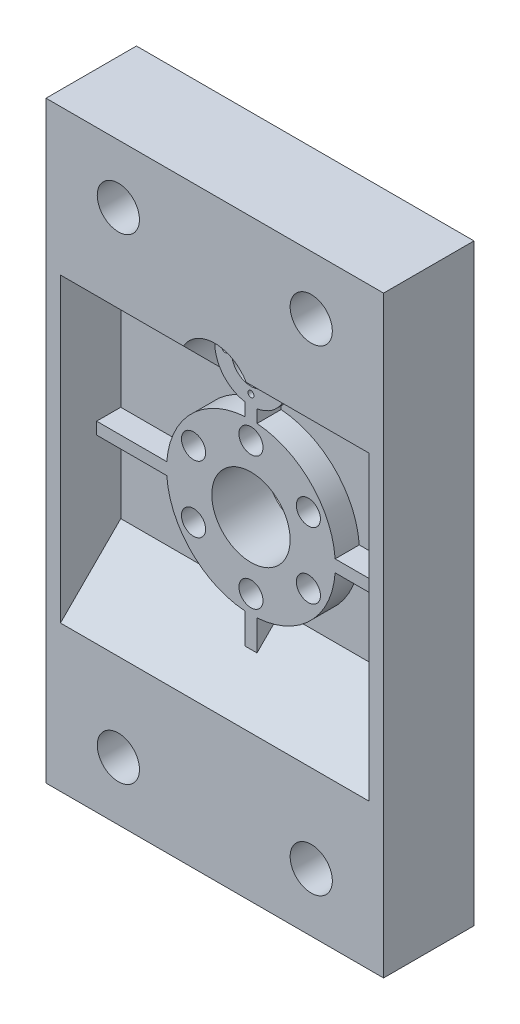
ISO-10303-21;
HEADER;
FILE_DESCRIPTION(('STEP AP214'),'2;1');
FILE_NAME('part.step','',(''),(''),'','','');
FILE_SCHEMA(('AUTOMOTIVE_DESIGN { 1 0 10303 214 1 1 1 1 }'));
ENDSEC;
DATA;
#1=APPLICATION_CONTEXT('core data for automotive mechanical design processes');
#2=APPLICATION_PROTOCOL_DEFINITION('international standard','automotive_design',2000,#1);
#3=PRODUCT_CONTEXT('',#1,'mechanical');
#4=PRODUCT('Part','Part','',(#3));
#5=PRODUCT_RELATED_PRODUCT_CATEGORY('part','',(#4));
#6=PRODUCT_DEFINITION_FORMATION('','',#4);
#7=PRODUCT_DEFINITION_CONTEXT('part definition',#1,'design');
#8=PRODUCT_DEFINITION('design','',#6,#7);
#9=PRODUCT_DEFINITION_SHAPE('','',#8);
#10=(LENGTH_UNIT() NAMED_UNIT(*) SI_UNIT(.MILLI.,.METRE.));
#11=(NAMED_UNIT(*) PLANE_ANGLE_UNIT() SI_UNIT($,.RADIAN.));
#12=(NAMED_UNIT(*) SI_UNIT($,.STERADIAN.) SOLID_ANGLE_UNIT());
#13=UNCERTAINTY_MEASURE_WITH_UNIT(LENGTH_MEASURE(1.E-05),#10,'distance_accuracy_value','');
#14=(GEOMETRIC_REPRESENTATION_CONTEXT(3) GLOBAL_UNCERTAINTY_ASSIGNED_CONTEXT((#13)) GLOBAL_UNIT_ASSIGNED_CONTEXT((#10,
#11,#12)) REPRESENTATION_CONTEXT('',''));
#15=CARTESIAN_POINT('',(0.,0.,0.));
#16=DIRECTION('',(0.,0.,1.));
#17=DIRECTION('',(1.,0.,0.));
#18=AXIS2_PLACEMENT_3D('',#15,#16,#17);
#19=CARTESIAN_POINT('',(-47.6313972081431,27.4999999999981,0.));
#20=DIRECTION('',(0.,0.,1.));
#21=DIRECTION('',(1.,0.,0.));
#22=AXIS2_PLACEMENT_3D('',#19,#20,#21);
#23=CYLINDRICAL_SURFACE('',#22,6.50000000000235);
#24=CARTESIAN_POINT('',(-47.6313972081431,27.4999999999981,0.));
#25=DIRECTION('',(0.,0.,1.));
#26=DIRECTION('',(1.,0.,0.));
#27=AXIS2_PLACEMENT_3D('',#24,#25,#26);
#28=CIRCLE('',#27,6.50000000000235);
#29=CARTESIAN_POINT('',(-41.1313972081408,27.4999999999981,0.));
#30=VERTEX_POINT('',#29);
#31=EDGE_CURVE('E611',#30,#30,#28,.T.);
#32=ORIENTED_EDGE('',*,*,#31,.F.);
#33=EDGE_LOOP('',(#32));
#34=FACE_BOUND('',#33,.T.);
#35=CARTESIAN_POINT('',(-47.6313972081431,27.4999999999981,30.));
#36=DIRECTION('',(0.,0.,1.));
#37=DIRECTION('',(1.,0.,0.));
#38=AXIS2_PLACEMENT_3D('',#35,#36,#37);
#39=CIRCLE('',#38,6.50000000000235);
#40=CARTESIAN_POINT('',(-41.1313972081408,27.4999999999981,30.));
#41=VERTEX_POINT('',#40);
#42=EDGE_CURVE('E45',#41,#41,#39,.F.);
#43=ORIENTED_EDGE('',*,*,#42,.F.);
#44=EDGE_LOOP('',(#43));
#45=FACE_BOUND('',#44,.T.);
#46=ADVANCED_FACE('F41',(#34,#45),#23,.F.);
#47=CARTESIAN_POINT('',(-47.6313972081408,-27.5000000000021,0.));
#48=DIRECTION('',(0.,0.,1.));
#49=DIRECTION('',(1.,0.,0.));
#50=AXIS2_PLACEMENT_3D('',#47,#48,#49);
#51=CYLINDRICAL_SURFACE('',#50,6.50000000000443);
#52=CARTESIAN_POINT('',(-47.6313972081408,-27.5000000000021,0.));
#53=DIRECTION('',(0.,0.,1.));
#54=DIRECTION('',(1.,0.,0.));
#55=AXIS2_PLACEMENT_3D('',#52,#53,#54);
#56=CIRCLE('',#55,6.50000000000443);
#57=CARTESIAN_POINT('',(-41.1313972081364,-27.5000000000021,0.));
#58=VERTEX_POINT('',#57);
#59=EDGE_CURVE('E648',#58,#58,#56,.T.);
#60=ORIENTED_EDGE('',*,*,#59,.F.);
#61=EDGE_LOOP('',(#60));
#62=FACE_BOUND('',#61,.T.);
#63=CARTESIAN_POINT('',(-47.6313972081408,-27.5000000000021,30.));
#64=DIRECTION('',(0.,0.,1.));
#65=DIRECTION('',(1.,0.,0.));
#66=AXIS2_PLACEMENT_3D('',#63,#64,#65);
#67=CIRCLE('',#66,6.50000000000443);
#68=CARTESIAN_POINT('',(-41.1313972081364,-27.5000000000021,30.));
#69=VERTEX_POINT('',#68);
#70=EDGE_CURVE('E622',#69,#69,#67,.F.);
#71=ORIENTED_EDGE('',*,*,#70,.F.);
#72=EDGE_LOOP('',(#71));
#73=FACE_BOUND('',#72,.T.);
#74=ADVANCED_FACE('F902',(#62,#73),#51,.F.);
#75=CARTESIAN_POINT('',(4.64835536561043E-12,-55.0000000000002,0.));
#76=DIRECTION('',(0.,0.,1.));
#77=DIRECTION('',(1.,0.,0.));
#78=AXIS2_PLACEMENT_3D('',#75,#76,#77);
#79=CYLINDRICAL_SURFACE('',#78,6.50000000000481);
#80=CARTESIAN_POINT('',(4.64835536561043E-12,-55.0000000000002,0.));
#81=DIRECTION('',(0.,0.,1.));
#82=DIRECTION('',(1.,0.,0.));
#83=AXIS2_PLACEMENT_3D('',#80,#81,#82);
#84=CIRCLE('',#83,6.50000000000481);
#85=CARTESIAN_POINT('',(6.50000000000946,-55.0000000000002,0.));
#86=VERTEX_POINT('',#85);
#87=EDGE_CURVE('E645',#86,#86,#84,.T.);
#88=ORIENTED_EDGE('',*,*,#87,.F.);
#89=EDGE_LOOP('',(#88));
#90=FACE_BOUND('',#89,.T.);
#91=CARTESIAN_POINT('',(4.64835536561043E-12,-55.0000000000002,30.));
#92=DIRECTION('',(0.,0.,1.));
#93=DIRECTION('',(1.,0.,0.));
#94=AXIS2_PLACEMENT_3D('',#91,#92,#93);
#95=CIRCLE('',#94,6.50000000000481);
#96=CARTESIAN_POINT('',(6.50000000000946,-55.0000000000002,30.));
#97=VERTEX_POINT('',#96);
#98=EDGE_CURVE('E620',#97,#97,#95,.F.);
#99=ORIENTED_EDGE('',*,*,#98,.F.);
#100=EDGE_LOOP('',(#99));
#101=FACE_BOUND('',#100,.T.);
#102=ADVANCED_FACE('F908',(#90,#101),#79,.F.);
#103=CARTESIAN_POINT('',(47.6313972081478,-27.4999999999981,0.));
#104=DIRECTION('',(0.,0.,1.));
#105=DIRECTION('',(1.,0.,0.));
#106=AXIS2_PLACEMENT_3D('',#103,#104,#105);
#107=CYLINDRICAL_SURFACE('',#106,6.50000000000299);
#108=CARTESIAN_POINT('',(47.6313972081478,-27.4999999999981,0.));
#109=DIRECTION('',(0.,0.,1.));
#110=DIRECTION('',(1.,0.,0.));
#111=AXIS2_PLACEMENT_3D('',#108,#109,#110);
#112=CIRCLE('',#111,6.50000000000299);
#113=CARTESIAN_POINT('',(54.1313972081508,-27.4999999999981,0.));
#114=VERTEX_POINT('',#113);
#115=EDGE_CURVE('E642',#114,#114,#112,.T.);
#116=ORIENTED_EDGE('',*,*,#115,.F.);
#117=EDGE_LOOP('',(#116));
#118=FACE_BOUND('',#117,.T.);
#119=CARTESIAN_POINT('',(47.6313972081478,-27.4999999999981,30.));
#120=DIRECTION('',(0.,0.,1.));
#121=DIRECTION('',(1.,0.,0.));
#122=AXIS2_PLACEMENT_3D('',#119,#120,#121);
#123=CIRCLE('',#122,6.50000000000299);
#124=CARTESIAN_POINT('',(54.1313972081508,-27.4999999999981,30.));
#125=VERTEX_POINT('',#124);
#126=EDGE_CURVE('E616',#125,#125,#123,.F.);
#127=ORIENTED_EDGE('',*,*,#126,.F.);
#128=EDGE_LOOP('',(#127));
#129=FACE_BOUND('',#128,.T.);
#130=ADVANCED_FACE('F1299',(#118,#129),#107,.F.);
#131=CARTESIAN_POINT('',(47.6313972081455,27.5000000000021,0.));
#132=DIRECTION('',(0.,0.,1.));
#133=DIRECTION('',(1.,0.,0.));
#134=AXIS2_PLACEMENT_3D('',#131,#132,#133);
#135=CYLINDRICAL_SURFACE('',#134,6.50000000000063);
#136=CARTESIAN_POINT('',(47.6313972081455,27.5000000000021,0.));
#137=DIRECTION('',(0.,0.,1.));
#138=DIRECTION('',(1.,0.,0.));
#139=AXIS2_PLACEMENT_3D('',#136,#137,#138);
#140=CIRCLE('',#139,6.50000000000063);
#141=CARTESIAN_POINT('',(54.1313972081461,27.5000000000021,0.));
#142=VERTEX_POINT('',#141);
#143=EDGE_CURVE('E638',#142,#142,#140,.T.);
#144=ORIENTED_EDGE('',*,*,#143,.F.);
#145=EDGE_LOOP('',(#144));
#146=FACE_BOUND('',#145,.T.);
#147=CARTESIAN_POINT('',(47.6313972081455,27.5000000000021,30.));
#148=DIRECTION('',(0.,0.,1.));
#149=DIRECTION('',(1.,0.,0.));
#150=AXIS2_PLACEMENT_3D('',#147,#148,#149);
#151=CIRCLE('',#150,6.50000000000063);
#152=CARTESIAN_POINT('',(54.1313972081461,27.5000000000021,30.));
#153=VERTEX_POINT('',#152);
#154=EDGE_CURVE('E613',#153,#153,#151,.F.);
#155=ORIENTED_EDGE('',*,*,#154,.F.);
#156=EDGE_LOOP('',(#155));
#157=FACE_BOUND('',#156,.T.);
#158=ADVANCED_FACE('F918',(#146,#157),#135,.F.);
#159=CARTESIAN_POINT('',(0.,55.0000000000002,0.));
#160=DIRECTION('',(0.,0.,1.));
#161=DIRECTION('',(1.,0.,0.));
#162=AXIS2_PLACEMENT_3D('',#159,#160,#161);
#163=CYLINDRICAL_SURFACE('',#162,6.5);
#164=CARTESIAN_POINT('',(0.,55.0000000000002,0.));
#165=DIRECTION('',(0.,0.,1.));
#166=DIRECTION('',(1.,0.,0.));
#167=AXIS2_PLACEMENT_3D('',#164,#165,#166);
#168=CIRCLE('',#167,6.5);
#169=CARTESIAN_POINT('',(6.5,55.0000000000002,0.));
#170=VERTEX_POINT('',#169);
#171=EDGE_CURVE('E641',#170,#170,#168,.T.);
#172=ORIENTED_EDGE('',*,*,#171,.F.);
#173=EDGE_LOOP('',(#172));
#174=FACE_BOUND('',#173,.T.);
#175=CARTESIAN_POINT('',(0.,55.0000000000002,30.));
#176=DIRECTION('',(0.,0.,1.));
#177=DIRECTION('',(1.,0.,0.));
#178=AXIS2_PLACEMENT_3D('',#175,#176,#177);
#179=CIRCLE('',#178,6.5);
#180=CARTESIAN_POINT('',(6.5,55.0000000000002,30.));
#181=VERTEX_POINT('',#180);
#182=EDGE_CURVE('E608',#181,#181,#179,.F.);
#183=ORIENTED_EDGE('',*,*,#182,.F.);
#184=EDGE_LOOP('',(#183));
#185=FACE_BOUND('',#184,.T.);
#186=ADVANCED_FACE('F915',(#174,#185),#163,.F.);
#187=CARTESIAN_POINT('',(-198.710678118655,-74.9999999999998,25.));
#188=DIRECTION('',(0.,0.707106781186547,0.707106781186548));
#189=DIRECTION('',(0.,-0.707106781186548,0.707106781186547));
#190=AXIS2_PLACEMENT_3D('',#187,#188,#189);
#191=PLANE('',#190);
#192=DIRECTION('',(1.,0.,0.));
#193=VECTOR('',#192,1.);
#194=CARTESIAN_POINT('',(-128.,-74.9999999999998,25.));
#195=LINE('',#194,#193);
#196=CARTESIAN_POINT('',(5.00000000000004,-74.9999999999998,25.));
#197=VERTEX_POINT('',#196);
#198=CARTESIAN_POINT('',(128.,-74.9999999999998,25.));
#199=VERTEX_POINT('',#198);
#200=EDGE_CURVE('E372',#197,#199,#195,.T.);
#201=ORIENTED_EDGE('',*,*,#200,.F.);
#202=DIRECTION('',(0.,0.707106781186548,-0.707106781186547));
#203=VECTOR('',#202,1.);
#204=CARTESIAN_POINT('',(5.00000000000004,-250037.500000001,249987.5));
#205=LINE('',#204,#203);
#206=CARTESIAN_POINT('',(5.00000000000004,-94.9999999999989,44.9999999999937));
#207=VERTEX_POINT('',#206);
#208=EDGE_CURVE('E355',#207,#197,#205,.T.);
#209=ORIENTED_EDGE('',*,*,#208,.F.);
#210=DIRECTION('',(1.,0.,0.));
#211=VECTOR('',#210,1.);
#212=CARTESIAN_POINT('',(5.00000000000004,-94.9999999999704,45.));
#213=LINE('',#212,#211);
#214=CARTESIAN_POINT('',(-4.99999999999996,-94.9999999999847,44.9999999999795));
#215=VERTEX_POINT('',#214);
#216=EDGE_CURVE('E352',#215,#207,#213,.T.);
#217=ORIENTED_EDGE('',*,*,#216,.F.);
#218=DIRECTION('',(0.,-0.707106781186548,0.707106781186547));
#219=VECTOR('',#218,1.);
#220=CARTESIAN_POINT('',(-4.99999999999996,-250047.500000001,249997.5));
#221=LINE('',#220,#219);
#222=CARTESIAN_POINT('',(-4.99999999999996,-74.9999999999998,25.));
#223=VERTEX_POINT('',#222);
#224=EDGE_CURVE('E343',#223,#215,#221,.T.);
#225=ORIENTED_EDGE('',*,*,#224,.F.);
#226=CARTESIAN_POINT('',(-128.,-74.9999999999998,25.));
#227=VERTEX_POINT('',#226);
#228=EDGE_CURVE('E349',#227,#223,#195,.T.);
#229=ORIENTED_EDGE('',*,*,#228,.F.);
#230=DIRECTION('',(0.,-0.707106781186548,0.707106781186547));
#231=VECTOR('',#230,1.);
#232=CARTESIAN_POINT('',(-128.,-74.9999999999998,25.));
#233=LINE('',#232,#231);
#234=CARTESIAN_POINT('',(-128.,-125.,75.));
#235=VERTEX_POINT('',#234);
#236=EDGE_CURVE('E385',#227,#235,#233,.T.);
#237=ORIENTED_EDGE('',*,*,#236,.T.);
#238=DIRECTION('',(1.,0.,0.));
#239=VECTOR('',#238,1.);
#240=CARTESIAN_POINT('',(-198.710678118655,-125.,75.));
#241=LINE('',#240,#239);
#242=CARTESIAN_POINT('',(128.,-125.,75.));
#243=VERTEX_POINT('',#242);
#244=EDGE_CURVE('E798',#235,#243,#241,.T.);
#245=ORIENTED_EDGE('',*,*,#244,.T.);
#246=DIRECTION('',(0.,-0.707106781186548,0.707106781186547));
#247=VECTOR('',#246,1.);
#248=CARTESIAN_POINT('',(128.,-74.9999999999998,25.));
#249=LINE('',#248,#247);
#250=EDGE_CURVE('E793',#199,#243,#249,.T.);
#251=ORIENTED_EDGE('',*,*,#250,.F.);
#252=EDGE_LOOP('',(#201,#209,#217,#225,#229,#237,#245,#251));
#253=FACE_BOUND('',#252,.T.);
#254=ADVANCED_FACE('F346',(#253),#191,.T.);
#255=CARTESIAN_POINT('',(0.,0.,25.));
#256=DIRECTION('',(0.,0.,-1.));
#257=DIRECTION('',(-1.,0.,0.));
#258=AXIS2_PLACEMENT_3D('',#255,#256,#257);
#259=PLANE('',#258);
#260=DIRECTION('',(-1.,0.,0.));
#261=VECTOR('',#260,1.);
#262=CARTESIAN_POINT('',(0.,-4.99999999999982,25.));
#263=LINE('',#262,#261);
#264=CARTESIAN_POINT('',(-69.8212002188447,-4.99999999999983,25.));
#265=VERTEX_POINT('',#264);
#266=CARTESIAN_POINT('',(-128.,-4.99999999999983,25.));
#267=VERTEX_POINT('',#266);
#268=EDGE_CURVE('E681',#265,#267,#263,.T.);
#269=ORIENTED_EDGE('',*,*,#268,.T.);
#270=DIRECTION('',(0.,-1.,0.));
#271=VECTOR('',#270,1.);
#272=CARTESIAN_POINT('',(-128.,-74.9999999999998,25.));
#273=LINE('',#272,#271);
#274=EDGE_CURVE('E370',#267,#227,#273,.T.);
#275=ORIENTED_EDGE('',*,*,#274,.T.);
#276=ORIENTED_EDGE('',*,*,#228,.T.);
#277=DIRECTION('',(0.,1.,0.));
#278=VECTOR('',#277,1.);
#279=CARTESIAN_POINT('',(-5.00000000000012,0.,25.));
#280=LINE('',#279,#278);
#281=CARTESIAN_POINT('',(-4.99999999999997,-69.8212002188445,25.));
#282=VERTEX_POINT('',#281);
#283=EDGE_CURVE('E359',#223,#282,#280,.T.);
#284=ORIENTED_EDGE('',*,*,#283,.T.);
#285=CARTESIAN_POINT('',(0.,1.94289029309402E-13,25.));
#286=DIRECTION('',(0.,0.,-1.));
#287=DIRECTION('',(-1.,0.,0.));
#288=AXIS2_PLACEMENT_3D('',#285,#286,#287);
#289=CIRCLE('',#288,70.);
#290=EDGE_CURVE('E50',#265,#282,#289,.F.);
#291=ORIENTED_EDGE('',*,*,#290,.F.);
#292=EDGE_LOOP('',(#269,#275,#276,#284,#291));
#293=FACE_BOUND('',#292,.T.);
#294=ADVANCED_FACE('F368',(#293),#259,.F.);
#295=CARTESIAN_POINT('',(0.,1.94289029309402E-13,45.));
#296=DIRECTION('',(0.,0.,-1.));
#297=DIRECTION('',(-1.,0.,0.));
#298=AXIS2_PLACEMENT_3D('',#295,#296,#297);
#299=CYLINDRICAL_SURFACE('',#298,70.);
#300=DIRECTION('',(0.,0.,1.));
#301=VECTOR('',#300,1.);
#302=CARTESIAN_POINT('',(-69.8212002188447,-4.99999999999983,-34.031963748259));
#303=LINE('',#302,#301);
#304=CARTESIAN_POINT('',(-69.8212002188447,-4.99999999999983,45.));
#305=VERTEX_POINT('',#304);
#306=EDGE_CURVE('E683',#265,#305,#303,.T.);
#307=ORIENTED_EDGE('',*,*,#306,.F.);
#308=ORIENTED_EDGE('',*,*,#290,.T.);
#309=DIRECTION('',(0.,0.,1.));
#310=VECTOR('',#309,1.);
#311=CARTESIAN_POINT('',(-4.99999999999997,-69.8212002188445,-34.031963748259));
#312=LINE('',#311,#310);
#313=CARTESIAN_POINT('',(-4.99999999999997,-69.8212002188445,45.));
#314=VERTEX_POINT('',#313);
#315=EDGE_CURVE('E362',#282,#314,#312,.T.);
#316=ORIENTED_EDGE('',*,*,#315,.T.);
#317=CARTESIAN_POINT('',(0.,1.94289029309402E-13,45.));
#318=DIRECTION('',(0.,0.,1.));
#319=DIRECTION('',(1.,0.,0.));
#320=AXIS2_PLACEMENT_3D('',#317,#318,#319);
#321=CIRCLE('',#320,70.);
#322=EDGE_CURVE('E769',#305,#314,#321,.T.);
#323=ORIENTED_EDGE('',*,*,#322,.F.);
#324=EDGE_LOOP('',(#307,#308,#316,#323));
#325=FACE_BOUND('',#324,.T.);
#326=ADVANCED_FACE('F887',(#325),#299,.T.);
#327=CARTESIAN_POINT('',(-128.,75.0000000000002,25.));
#328=VERTEX_POINT('',#327);
#329=CARTESIAN_POINT('',(-128.,5.00000000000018,25.));
#330=VERTEX_POINT('',#329);
#331=EDGE_CURVE('E377',#328,#330,#273,.T.);
#332=ORIENTED_EDGE('',*,*,#331,.T.);
#333=DIRECTION('',(-1.,0.,0.));
#334=VECTOR('',#333,1.);
#335=CARTESIAN_POINT('',(0.,5.0000000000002,25.));
#336=LINE('',#335,#334);
#337=CARTESIAN_POINT('',(-69.8212002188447,5.00000000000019,25.));
#338=VERTEX_POINT('',#337);
#339=EDGE_CURVE('E691',#338,#330,#336,.T.);
#340=ORIENTED_EDGE('',*,*,#339,.F.);
#341=CARTESIAN_POINT('',(-4.99999999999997,69.8212002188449,25.));
#342=VERTEX_POINT('',#341);
#343=EDGE_CURVE('E12',#342,#338,#289,.F.);
#344=ORIENTED_EDGE('',*,*,#343,.F.);
#345=DIRECTION('',(0.,1.,0.));
#346=VECTOR('',#345,1.);
#347=CARTESIAN_POINT('',(-4.99999999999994,0.,25.));
#348=LINE('',#347,#346);
#349=CARTESIAN_POINT('',(-4.99999999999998,75.0000000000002,25.));
#350=VERTEX_POINT('',#349);
#351=EDGE_CURVE('E739',#342,#350,#348,.T.);
#352=ORIENTED_EDGE('',*,*,#351,.T.);
#353=DIRECTION('',(-1.,0.,0.));
#354=VECTOR('',#353,1.);
#355=CARTESIAN_POINT('',(-128.,75.0000000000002,25.));
#356=LINE('',#355,#354);
#357=EDGE_CURVE('E804',#350,#328,#356,.T.);
#358=ORIENTED_EDGE('',*,*,#357,.T.);
#359=EDGE_LOOP('',(#332,#340,#344,#352,#358));
#360=FACE_BOUND('',#359,.T.);
#361=ADVANCED_FACE('F813',(#360),#259,.F.);
#362=ORIENTED_EDGE('',*,*,#343,.T.);
#363=DIRECTION('',(0.,0.,1.));
#364=VECTOR('',#363,1.);
#365=CARTESIAN_POINT('',(-69.8212002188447,5.00000000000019,-34.031963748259));
#366=LINE('',#365,#364);
#367=CARTESIAN_POINT('',(-69.8212002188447,5.00000000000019,45.));
#368=VERTEX_POINT('',#367);
#369=EDGE_CURVE('E365',#338,#368,#366,.T.);
#370=ORIENTED_EDGE('',*,*,#369,.T.);
#371=CARTESIAN_POINT('',(-4.99999999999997,69.8212002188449,45.));
#372=VERTEX_POINT('',#371);
#373=EDGE_CURVE('E765',#372,#368,#321,.T.);
#374=ORIENTED_EDGE('',*,*,#373,.F.);
#375=DIRECTION('',(0.,0.,1.));
#376=VECTOR('',#375,1.);
#377=CARTESIAN_POINT('',(-4.99999999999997,69.8212002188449,-34.031963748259));
#378=LINE('',#377,#376);
#379=EDGE_CURVE('E742',#342,#372,#378,.T.);
#380=ORIENTED_EDGE('',*,*,#379,.F.);
#381=EDGE_LOOP('',(#362,#370,#374,#380));
#382=FACE_BOUND('',#381,.T.);
#383=ADVANCED_FACE('F832',(#382),#299,.T.);
#384=CARTESIAN_POINT('',(5.00000000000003,-69.8212002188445,25.));
#385=VERTEX_POINT('',#384);
#386=CARTESIAN_POINT('',(69.8212002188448,-4.9999999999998,25.));
#387=VERTEX_POINT('',#386);
#388=EDGE_CURVE('E869',#385,#387,#289,.F.);
#389=ORIENTED_EDGE('',*,*,#388,.F.);
#390=DIRECTION('',(0.,1.,0.));
#391=VECTOR('',#390,1.);
#392=CARTESIAN_POINT('',(4.99999999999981,0.,25.));
#393=LINE('',#392,#391);
#394=EDGE_CURVE('E702',#197,#385,#393,.T.);
#395=ORIENTED_EDGE('',*,*,#394,.F.);
#396=ORIENTED_EDGE('',*,*,#200,.T.);
#397=DIRECTION('',(0.,1.,0.));
#398=VECTOR('',#397,1.);
#399=CARTESIAN_POINT('',(128.,-74.9999999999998,25.));
#400=LINE('',#399,#398);
#401=CARTESIAN_POINT('',(128.,-4.9999999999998,25.));
#402=VERTEX_POINT('',#401);
#403=EDGE_CURVE('E802',#199,#402,#400,.T.);
#404=ORIENTED_EDGE('',*,*,#403,.T.);
#405=DIRECTION('',(-1.,0.,0.));
#406=VECTOR('',#405,1.);
#407=CARTESIAN_POINT('',(0.,-4.99999999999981,25.));
#408=LINE('',#407,#406);
#409=EDGE_CURVE('E704',#402,#387,#408,.T.);
#410=ORIENTED_EDGE('',*,*,#409,.T.);
#411=EDGE_LOOP('',(#389,#395,#396,#404,#410));
#412=FACE_BOUND('',#411,.T.);
#413=ADVANCED_FACE('F858',(#412),#259,.F.);
#414=CARTESIAN_POINT('',(5.00000000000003,-69.8212002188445,45.));
#415=VERTEX_POINT('',#414);
#416=CARTESIAN_POINT('',(69.8212002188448,-4.9999999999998,45.));
#417=VERTEX_POINT('',#416);
#418=EDGE_CURVE('E868',#415,#417,#321,.T.);
#419=ORIENTED_EDGE('',*,*,#418,.F.);
#420=DIRECTION('',(0.,0.,1.));
#421=VECTOR('',#420,1.);
#422=CARTESIAN_POINT('',(5.00000000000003,-69.8212002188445,-34.031963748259));
#423=LINE('',#422,#421);
#424=EDGE_CURVE('E707',#385,#415,#423,.T.);
#425=ORIENTED_EDGE('',*,*,#424,.F.);
#426=ORIENTED_EDGE('',*,*,#388,.T.);
#427=DIRECTION('',(0.,0.,1.));
#428=VECTOR('',#427,1.);
#429=CARTESIAN_POINT('',(69.8212002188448,-4.9999999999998,-34.031963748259));
#430=LINE('',#429,#428);
#431=EDGE_CURVE('E729',#387,#417,#430,.T.);
#432=ORIENTED_EDGE('',*,*,#431,.T.);
#433=EDGE_LOOP('',(#419,#425,#426,#432));
#434=FACE_BOUND('',#433,.T.);
#435=ADVANCED_FACE('F866',(#434),#299,.T.);
#436=CARTESIAN_POINT('',(-198.710678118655,75.0000000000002,25.));
#437=DIRECTION('',(0.,-0.707106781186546,0.707106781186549));
#438=DIRECTION('',(0.,-0.707106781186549,-0.707106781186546));
#439=AXIS2_PLACEMENT_3D('',#436,#437,#438);
#440=PLANE('',#439);
#441=ORIENTED_EDGE('',*,*,#357,.F.);
#442=DIRECTION('',(0.,0.707106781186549,0.707106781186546));
#443=VECTOR('',#442,1.);
#444=CARTESIAN_POINT('',(-4.99999999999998,75.0000000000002,25.));
#445=LINE('',#444,#443);
#446=CARTESIAN_POINT('',(-4.99999999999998,80.4196010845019,30.4196010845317));
#447=VERTEX_POINT('',#446);
#448=EDGE_CURVE('E748',#350,#447,#445,.T.);
#449=ORIENTED_EDGE('',*,*,#448,.T.);
#450=CARTESIAN_POINT('',(0.,110.,60.0000000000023));
#451=DIRECTION('',(0.,-0.707106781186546,0.707106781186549));
#452=DIRECTION('',(0.,0.707106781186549,0.707106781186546));
#453=AXIS2_PLACEMENT_3D('',#450,#451,#452);
#454=ELLIPSE('',#453,42.4264068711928,30.);
#455=CARTESIAN_POINT('',(-25.9807621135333,95.0000000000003,45.));
#456=VERTEX_POINT('',#455);
#457=EDGE_CURVE('E773',#447,#456,#454,.F.);
#458=ORIENTED_EDGE('',*,*,#457,.T.);
#459=CARTESIAN_POINT('',(0.,110.,59.9999999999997));
#460=DIRECTION('',(0.,-0.707106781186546,0.707106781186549));
#461=DIRECTION('',(0.,0.707106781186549,0.707106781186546));
#462=AXIS2_PLACEMENT_3D('',#459,#460,#461);
#463=ELLIPSE('',#462,42.4264068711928,30.);
#464=CARTESIAN_POINT('',(-25.980762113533,125.,75.));
#465=VERTEX_POINT('',#464);
#466=EDGE_CURVE('E604',#465,#456,#463,.T.);
#467=ORIENTED_EDGE('',*,*,#466,.F.);
#468=DIRECTION('',(1.,0.,0.));
#469=VECTOR('',#468,1.);
#470=CARTESIAN_POINT('',(-198.710678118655,125.,75.));
#471=LINE('',#470,#469);
#472=CARTESIAN_POINT('',(-128.,125.,75.));
#473=VERTEX_POINT('',#472);
#474=EDGE_CURVE('E790',#473,#465,#471,.T.);
#475=ORIENTED_EDGE('',*,*,#474,.F.);
#476=DIRECTION('',(0.,-0.707106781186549,-0.707106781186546));
#477=VECTOR('',#476,1.);
#478=CARTESIAN_POINT('',(-128.,75.0000000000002,25.));
#479=LINE('',#478,#477);
#480=EDGE_CURVE('E789',#473,#328,#479,.T.);
#481=ORIENTED_EDGE('',*,*,#480,.T.);
#482=EDGE_LOOP('',(#441,#449,#458,#467,#475,#481));
#483=FACE_BOUND('',#482,.T.);
#484=ADVANCED_FACE('F820',(#483),#440,.T.);
#485=CARTESIAN_POINT('',(0.,110.,-500000.));
#486=DIRECTION('',(0.,0.,1.));
#487=DIRECTION('',(1.,0.,0.));
#488=AXIS2_PLACEMENT_3D('',#485,#486,#487);
#489=CYLINDRICAL_SURFACE('',#488,30.);
#490=ORIENTED_EDGE('',*,*,#457,.F.);
#491=DIRECTION('',(0.,0.,1.));
#492=VECTOR('',#491,1.);
#493=CARTESIAN_POINT('',(-4.99999999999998,80.4196010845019,-34.031963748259));
#494=LINE('',#493,#492);
#495=CARTESIAN_POINT('',(-4.99999999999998,80.4196010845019,45.));
#496=VERTEX_POINT('',#495);
#497=EDGE_CURVE('E735',#447,#496,#494,.T.);
#498=ORIENTED_EDGE('',*,*,#497,.T.);
#499=CARTESIAN_POINT('',(0.,110.,45.));
#500=DIRECTION('',(0.,0.,1.));
#501=DIRECTION('',(1.,0.,0.));
#502=AXIS2_PLACEMENT_3D('',#499,#500,#501);
#503=CIRCLE('',#502,30.);
#504=EDGE_CURVE('E770',#456,#496,#503,.T.);
#505=ORIENTED_EDGE('',*,*,#504,.F.);
#506=EDGE_LOOP('',(#490,#498,#505));
#507=FACE_BOUND('',#506,.T.);
#508=ADVANCED_FACE('F838',(#507),#489,.T.);
#509=CARTESIAN_POINT('',(69.8212002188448,5.0000000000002,25.));
#510=VERTEX_POINT('',#509);
#511=CARTESIAN_POINT('',(5.00000000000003,69.8212002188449,25.));
#512=VERTEX_POINT('',#511);
#513=EDGE_CURVE('E52',#510,#512,#289,.F.);
#514=ORIENTED_EDGE('',*,*,#513,.F.);
#515=DIRECTION('',(-1.,0.,0.));
#516=VECTOR('',#515,1.);
#517=CARTESIAN_POINT('',(0.,5.00000000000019,25.));
#518=LINE('',#517,#516);
#519=CARTESIAN_POINT('',(128.,5.0000000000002,25.));
#520=VERTEX_POINT('',#519);
#521=EDGE_CURVE('E718',#520,#510,#518,.T.);
#522=ORIENTED_EDGE('',*,*,#521,.F.);
#523=CARTESIAN_POINT('',(128.,75.0000000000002,25.));
#524=VERTEX_POINT('',#523);
#525=EDGE_CURVE('E387',#520,#524,#400,.T.);
#526=ORIENTED_EDGE('',*,*,#525,.T.);
#527=CARTESIAN_POINT('',(5.00000000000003,75.0000000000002,25.));
#528=VERTEX_POINT('',#527);
#529=EDGE_CURVE('E805',#524,#528,#356,.T.);
#530=ORIENTED_EDGE('',*,*,#529,.T.);
#531=DIRECTION('',(0.,1.,0.));
#532=VECTOR('',#531,1.);
#533=CARTESIAN_POINT('',(5.,0.,25.));
#534=LINE('',#533,#532);
#535=EDGE_CURVE('E743',#512,#528,#534,.T.);
#536=ORIENTED_EDGE('',*,*,#535,.F.);
#537=EDGE_LOOP('',(#514,#522,#526,#530,#536));
#538=FACE_BOUND('',#537,.T.);
#539=ADVANCED_FACE('F971',(#538),#259,.F.);
#540=CARTESIAN_POINT('',(0.,110.,75.));
#541=DIRECTION('',(0.,0.,-1.));
#542=DIRECTION('',(-1.,0.,0.));
#543=AXIS2_PLACEMENT_3D('',#540,#541,#542);
#544=CYLINDRICAL_SURFACE('',#543,16.);
#545=CARTESIAN_POINT('',(0.,110.,0.));
#546=DIRECTION('',(0.,0.,1.));
#547=DIRECTION('',(1.,0.,0.));
#548=AXIS2_PLACEMENT_3D('',#545,#546,#547);
#549=CIRCLE('',#548,16.);
#550=CARTESIAN_POINT('',(16.,110.,0.));
#551=VERTEX_POINT('',#550);
#552=EDGE_CURVE('E562',#551,#551,#549,.T.);
#553=ORIENTED_EDGE('',*,*,#552,.F.);
#554=EDGE_LOOP('',(#553));
#555=FACE_BOUND('',#554,.T.);
#556=CARTESIAN_POINT('',(0.,110.,45.));
#557=DIRECTION('',(0.,0.,1.));
#558=DIRECTION('',(1.,0.,0.));
#559=AXIS2_PLACEMENT_3D('',#556,#557,#558);
#560=CIRCLE('',#559,16.);
#561=CARTESIAN_POINT('',(16.,110.,45.));
#562=VERTEX_POINT('',#561);
#563=EDGE_CURVE('E777',#562,#562,#560,.T.);
#564=ORIENTED_EDGE('',*,*,#563,.T.);
#565=EDGE_LOOP('',(#564));
#566=FACE_BOUND('',#565,.T.);
#567=ADVANCED_FACE('F974',(#555,#566),#544,.F.);
#568=CARTESIAN_POINT('',(0.,0.,75.));
#569=DIRECTION('',(0.,0.,-1.));
#570=DIRECTION('',(-1.,0.,0.));
#571=AXIS2_PLACEMENT_3D('',#568,#569,#570);
#572=PLANE('',#571);
#573=DIRECTION('',(0.,-1.,0.));
#574=VECTOR('',#573,1.);
#575=CARTESIAN_POINT('',(-140.,246.,75.));
#576=LINE('',#575,#574);
#577=CARTESIAN_POINT('',(-140.,246.,75.));
#578=VERTEX_POINT('',#577);
#579=CARTESIAN_POINT('',(-140.,-246.,75.));
#580=VERTEX_POINT('',#579);
#581=EDGE_CURVE('E575',#578,#580,#576,.T.);
#582=ORIENTED_EDGE('',*,*,#581,.T.);
#583=DIRECTION('',(1.,0.,0.));
#584=VECTOR('',#583,1.);
#585=CARTESIAN_POINT('',(140.,-246.,75.));
#586=LINE('',#585,#584);
#587=CARTESIAN_POINT('',(140.,-246.,75.));
#588=VERTEX_POINT('',#587);
#589=EDGE_CURVE('E578',#580,#588,#586,.T.);
#590=ORIENTED_EDGE('',*,*,#589,.T.);
#591=DIRECTION('',(0.,1.,0.));
#592=VECTOR('',#591,1.);
#593=CARTESIAN_POINT('',(140.,246.,75.));
#594=LINE('',#593,#592);
#595=CARTESIAN_POINT('',(140.,246.,75.));
#596=VERTEX_POINT('',#595);
#597=EDGE_CURVE('E581',#588,#596,#594,.T.);
#598=ORIENTED_EDGE('',*,*,#597,.T.);
#599=DIRECTION('',(-1.,0.,0.));
#600=VECTOR('',#599,1.);
#601=CARTESIAN_POINT('',(140.,246.,75.));
#602=LINE('',#601,#600);
#603=EDGE_CURVE('E583',#596,#578,#602,.T.);
#604=ORIENTED_EDGE('',*,*,#603,.T.);
#605=EDGE_LOOP('',(#582,#590,#598,#604));
#606=FACE_BOUND('',#605,.T.);
#607=CARTESIAN_POINT('',(79.9999999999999,197.5,75.));
#608=DIRECTION('',(0.,0.,1.));
#609=DIRECTION('',(1.,0.,0.));
#610=AXIS2_PLACEMENT_3D('',#607,#608,#609);
#611=CIRCLE('',#610,17.5);
#612=CARTESIAN_POINT('',(97.4999999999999,197.5,75.));
#613=VERTEX_POINT('',#612);
#614=EDGE_CURVE('E568',#613,#613,#611,.T.);
#615=ORIENTED_EDGE('',*,*,#614,.F.);
#616=EDGE_LOOP('',(#615));
#617=FACE_BOUND('',#616,.T.);
#618=CARTESIAN_POINT('',(79.9999999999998,-197.5,75.));
#619=DIRECTION('',(0.,0.,1.));
#620=DIRECTION('',(-1.,0.,0.));
#621=AXIS2_PLACEMENT_3D('',#618,#619,#620);
#622=CIRCLE('',#621,17.5);
#623=CARTESIAN_POINT('',(62.4999999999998,-197.5,75.));
#624=VERTEX_POINT('',#623);
#625=EDGE_CURVE('E565',#624,#624,#622,.T.);
#626=ORIENTED_EDGE('',*,*,#625,.F.);
#627=EDGE_LOOP('',(#626));
#628=FACE_BOUND('',#627,.T.);
#629=CARTESIAN_POINT('',(-79.9999999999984,-197.5,75.));
#630=DIRECTION('',(0.,0.,1.));
#631=DIRECTION('',(1.,0.,0.));
#632=AXIS2_PLACEMENT_3D('',#629,#630,#631);
#633=CIRCLE('',#632,17.5);
#634=CARTESIAN_POINT('',(-62.4999999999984,-197.5,75.));
#635=VERTEX_POINT('',#634);
#636=EDGE_CURVE('E559',#635,#635,#633,.T.);
#637=ORIENTED_EDGE('',*,*,#636,.F.);
#638=EDGE_LOOP('',(#637));
#639=FACE_BOUND('',#638,.T.);
#640=CARTESIAN_POINT('',(-80.0000000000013,197.5,75.));
#641=DIRECTION('',(0.,0.,1.));
#642=DIRECTION('',(-1.,0.,0.));
#643=AXIS2_PLACEMENT_3D('',#640,#641,#642);
#644=CIRCLE('',#643,17.5);
#645=CARTESIAN_POINT('',(-97.5000000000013,197.5,75.));
#646=VERTEX_POINT('',#645);
#647=EDGE_CURVE('E549',#646,#646,#644,.T.);
#648=ORIENTED_EDGE('',*,*,#647,.F.);
#649=EDGE_LOOP('',(#648));
#650=FACE_BOUND('',#649,.T.);
#651=ORIENTED_EDGE('',*,*,#474,.T.);
#652=CARTESIAN_POINT('',(0.,110.,75.));
#653=DIRECTION('',(0.,0.,1.));
#654=DIRECTION('',(1.,0.,0.));
#655=AXIS2_PLACEMENT_3D('',#652,#653,#654);
#656=CIRCLE('',#655,30.);
#657=CARTESIAN_POINT('',(25.980762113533,125.,75.));
#658=VERTEX_POINT('',#657);
#659=EDGE_CURVE('E780',#658,#465,#656,.T.);
#660=ORIENTED_EDGE('',*,*,#659,.F.);
#661=CARTESIAN_POINT('',(128.,125.,75.));
#662=VERTEX_POINT('',#661);
#663=EDGE_CURVE('E784',#658,#662,#471,.T.);
#664=ORIENTED_EDGE('',*,*,#663,.T.);
#665=DIRECTION('',(0.,1.,0.));
#666=VECTOR('',#665,1.);
#667=CARTESIAN_POINT('',(128.,-74.9999999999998,75.));
#668=LINE('',#667,#666);
#669=EDGE_CURVE('E381',#243,#662,#668,.T.);
#670=ORIENTED_EDGE('',*,*,#669,.F.);
#671=ORIENTED_EDGE('',*,*,#244,.F.);
#672=DIRECTION('',(0.,-1.,0.));
#673=VECTOR('',#672,1.);
#674=CARTESIAN_POINT('',(-128.,-74.9999999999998,75.));
#675=LINE('',#674,#673);
#676=EDGE_CURVE('E384',#473,#235,#675,.T.);
#677=ORIENTED_EDGE('',*,*,#676,.F.);
#678=EDGE_LOOP('',(#651,#660,#664,#670,#671,#677));
#679=FACE_BOUND('',#678,.T.);
#680=ADVANCED_FACE('F846',(#606,#617,#628,#639,#650,#679),#572,.F.);
#681=CARTESIAN_POINT('',(0.,0.,0.));
#682=DIRECTION('',(0.,0.,-1.));
#683=DIRECTION('',(-1.,0.,0.));
#684=AXIS2_PLACEMENT_3D('',#681,#682,#683);
#685=PLANE('',#684);
#686=ORIENTED_EDGE('',*,*,#143,.T.);
#687=EDGE_LOOP('',(#686));
#688=FACE_BOUND('',#687,.T.);
#689=ORIENTED_EDGE('',*,*,#115,.T.);
#690=EDGE_LOOP('',(#689));
#691=FACE_BOUND('',#690,.T.);
#692=ORIENTED_EDGE('',*,*,#87,.T.);
#693=EDGE_LOOP('',(#692));
#694=FACE_BOUND('',#693,.T.);
#695=ORIENTED_EDGE('',*,*,#59,.T.);
#696=EDGE_LOOP('',(#695));
#697=FACE_BOUND('',#696,.T.);
#698=ORIENTED_EDGE('',*,*,#31,.T.);
#699=EDGE_LOOP('',(#698));
#700=FACE_BOUND('',#699,.T.);
#701=ORIENTED_EDGE('',*,*,#171,.T.);
#702=EDGE_LOOP('',(#701));
#703=FACE_BOUND('',#702,.T.);
#704=DIRECTION('',(0.,1.,0.));
#705=VECTOR('',#704,1.);
#706=CARTESIAN_POINT('',(5.99999999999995,0.,0.));
#707=LINE('',#706,#705);
#708=CARTESIAN_POINT('',(5.99999999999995,139.393876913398,0.));
#709=VERTEX_POINT('',#708);
#710=CARTESIAN_POINT('',(5.99999999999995,234.,0.));
#711=VERTEX_POINT('',#710);
#712=EDGE_CURVE('E433',#709,#711,#707,.T.);
#713=ORIENTED_EDGE('',*,*,#712,.F.);
#714=CARTESIAN_POINT('',(0.,110.,0.));
#715=DIRECTION('',(0.,0.,-1.));
#716=DIRECTION('',(-1.,0.,0.));
#717=AXIS2_PLACEMENT_3D('',#714,#715,#716);
#718=CIRCLE('',#717,30.);
#719=CARTESIAN_POINT('',(27.9105714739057,99.,0.));
#720=VERTEX_POINT('',#719);
#721=EDGE_CURVE('E371',#709,#720,#718,.T.);
#722=ORIENTED_EDGE('',*,*,#721,.T.);
#723=DIRECTION('',(-1.,0.,0.));
#724=VECTOR('',#723,1.);
#725=CARTESIAN_POINT('',(198.710678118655,99.,0.));
#726=LINE('',#725,#724);
#727=CARTESIAN_POINT('',(128.,99.,0.));
#728=VERTEX_POINT('',#727);
#729=EDGE_CURVE('E434',#728,#720,#726,.T.);
#730=ORIENTED_EDGE('',*,*,#729,.F.);
#731=DIRECTION('',(0.,-1.,0.));
#732=VECTOR('',#731,1.);
#733=CARTESIAN_POINT('',(128.,0.,0.));
#734=LINE('',#733,#732);
#735=CARTESIAN_POINT('',(128.,234.,0.));
#736=VERTEX_POINT('',#735);
#737=EDGE_CURVE('E503',#736,#728,#734,.T.);
#738=ORIENTED_EDGE('',*,*,#737,.F.);
#739=DIRECTION('',(1.,0.,0.));
#740=VECTOR('',#739,1.);
#741=CARTESIAN_POINT('',(0.,234.,0.));
#742=LINE('',#741,#740);
#743=EDGE_CURVE('E517',#711,#736,#742,.T.);
#744=ORIENTED_EDGE('',*,*,#743,.F.);
#745=EDGE_LOOP('',(#713,#722,#730,#738,#744));
#746=FACE_BOUND('',#745,.T.);
#747=CARTESIAN_POINT('',(0.,110.,0.));
#748=DIRECTION('',(0.,0.,-1.));
#749=DIRECTION('',(-1.,0.,0.));
#750=AXIS2_PLACEMENT_3D('',#747,#748,#749);
#751=CIRCLE('',#750,30.);
#752=CARTESIAN_POINT('',(-27.9105714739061,99.000000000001,0.));
#753=VERTEX_POINT('',#752);
#754=CARTESIAN_POINT('',(-5.99999999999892,139.393876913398,0.));
#755=VERTEX_POINT('',#754);
#756=EDGE_CURVE('E390',#753,#755,#751,.T.);
#757=ORIENTED_EDGE('',*,*,#756,.T.);
#758=DIRECTION('',(0.,1.,0.));
#759=VECTOR('',#758,1.);
#760=CARTESIAN_POINT('',(-5.9999999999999,0.,0.));
#761=LINE('',#760,#759);
#762=CARTESIAN_POINT('',(-5.99999999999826,234.,0.));
#763=VERTEX_POINT('',#762);
#764=EDGE_CURVE('E488',#755,#763,#761,.T.);
#765=ORIENTED_EDGE('',*,*,#764,.T.);
#766=DIRECTION('',(-1.,0.,0.));
#767=VECTOR('',#766,1.);
#768=CARTESIAN_POINT('',(1.59708312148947E-12,234.,0.));
#769=LINE('',#768,#767);
#770=CARTESIAN_POINT('',(-127.999999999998,234.000000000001,0.));
#771=VERTEX_POINT('',#770);
#772=EDGE_CURVE('E476',#763,#771,#769,.T.);
#773=ORIENTED_EDGE('',*,*,#772,.T.);
#774=DIRECTION('',(0.,-1.,0.));
#775=VECTOR('',#774,1.);
#776=CARTESIAN_POINT('',(-128.,8.35932630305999E-13,0.));
#777=LINE('',#776,#775);
#778=CARTESIAN_POINT('',(-127.999999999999,99.0000000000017,0.));
#779=VERTEX_POINT('',#778);
#780=EDGE_CURVE('E490',#771,#779,#777,.T.);
#781=ORIENTED_EDGE('',*,*,#780,.T.);
#782=DIRECTION('',(-1.,0.,0.));
#783=VECTOR('',#782,1.);
#784=CARTESIAN_POINT('',(64.7106781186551,99.0000000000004,0.));
#785=LINE('',#784,#783);
#786=EDGE_CURVE('E415',#753,#779,#785,.T.);
#787=ORIENTED_EDGE('',*,*,#786,.F.);
#788=EDGE_LOOP('',(#757,#765,#773,#781,#787));
#789=FACE_BOUND('',#788,.T.);
#790=DIRECTION('',(0.,1.,0.));
#791=VECTOR('',#790,1.);
#792=CARTESIAN_POINT('',(128.,0.,0.));
#793=LINE('',#792,#791);
#794=CARTESIAN_POINT('',(128.,-234.,0.));
#795=VERTEX_POINT('',#794);
#796=CARTESIAN_POINT('',(128.,-100.305438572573,0.));
#797=VERTEX_POINT('',#796);
#798=EDGE_CURVE('E456',#795,#797,#793,.T.);
#799=ORIENTED_EDGE('',*,*,#798,.T.);
#800=DIRECTION('',(-1.,0.,0.));
#801=VECTOR('',#800,1.);
#802=CARTESIAN_POINT('',(198.710678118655,-100.305438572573,0.));
#803=LINE('',#802,#801);
#804=CARTESIAN_POINT('',(5.99999999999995,-100.305438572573,0.));
#805=VERTEX_POINT('',#804);
#806=EDGE_CURVE('E425',#797,#805,#803,.T.);
#807=ORIENTED_EDGE('',*,*,#806,.T.);
#808=DIRECTION('',(0.,-1.,0.));
#809=VECTOR('',#808,1.);
#810=CARTESIAN_POINT('',(5.99999999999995,0.,0.));
#811=LINE('',#810,#809);
#812=CARTESIAN_POINT('',(5.99999999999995,-234.,0.));
#813=VERTEX_POINT('',#812);
#814=EDGE_CURVE('E453',#805,#813,#811,.T.);
#815=ORIENTED_EDGE('',*,*,#814,.T.);
#816=DIRECTION('',(1.,0.,0.));
#817=VECTOR('',#816,1.);
#818=CARTESIAN_POINT('',(0.,-234.,0.));
#819=LINE('',#818,#817);
#820=EDGE_CURVE('E443',#813,#795,#819,.T.);
#821=ORIENTED_EDGE('',*,*,#820,.T.);
#822=EDGE_LOOP('',(#799,#807,#815,#821));
#823=FACE_BOUND('',#822,.T.);
#824=CARTESIAN_POINT('',(0.,1.94289029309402E-13,0.));
#825=DIRECTION('',(0.,0.,1.));
#826=DIRECTION('',(1.,0.,0.));
#827=AXIS2_PLACEMENT_3D('',#824,#825,#826);
#828=CIRCLE('',#827,32.5);
#829=CARTESIAN_POINT('',(32.5,1.94289029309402E-13,0.));
#830=VERTEX_POINT('',#829);
#831=EDGE_CURVE('E571',#830,#830,#828,.T.);
#832=ORIENTED_EDGE('',*,*,#831,.T.);
#833=EDGE_LOOP('',(#832));
#834=FACE_BOUND('',#833,.T.);
#835=DIRECTION('',(0.,-1.,0.));
#836=VECTOR('',#835,1.);
#837=CARTESIAN_POINT('',(-140.,246.,0.));
#838=LINE('',#837,#836);
#839=CARTESIAN_POINT('',(-140.,246.,0.));
#840=VERTEX_POINT('',#839);
#841=CARTESIAN_POINT('',(-140.,-246.,0.));
#842=VERTEX_POINT('',#841);
#843=EDGE_CURVE('E574',#840,#842,#838,.T.);
#844=ORIENTED_EDGE('',*,*,#843,.F.);
#845=DIRECTION('',(-1.,0.,0.));
#846=VECTOR('',#845,1.);
#847=CARTESIAN_POINT('',(140.,246.,0.));
#848=LINE('',#847,#846);
#849=CARTESIAN_POINT('',(140.,246.,0.));
#850=VERTEX_POINT('',#849);
#851=EDGE_CURVE('E579',#850,#840,#848,.T.);
#852=ORIENTED_EDGE('',*,*,#851,.F.);
#853=DIRECTION('',(0.,1.,0.));
#854=VECTOR('',#853,1.);
#855=CARTESIAN_POINT('',(140.,246.,0.));
#856=LINE('',#855,#854);
#857=CARTESIAN_POINT('',(140.,-246.,0.));
#858=VERTEX_POINT('',#857);
#859=EDGE_CURVE('E590',#858,#850,#856,.T.);
#860=ORIENTED_EDGE('',*,*,#859,.F.);
#861=DIRECTION('',(1.,0.,0.));
#862=VECTOR('',#861,1.);
#863=CARTESIAN_POINT('',(140.,-246.,0.));
#864=LINE('',#863,#862);
#865=EDGE_CURVE('E588',#842,#858,#864,.T.);
#866=ORIENTED_EDGE('',*,*,#865,.F.);
#867=EDGE_LOOP('',(#844,#852,#860,#866));
#868=FACE_BOUND('',#867,.T.);
#869=ORIENTED_EDGE('',*,*,#552,.T.);
#870=EDGE_LOOP('',(#869));
#871=FACE_BOUND('',#870,.T.);
#872=DIRECTION('',(-1.,0.,0.));
#873=VECTOR('',#872,1.);
#874=CARTESIAN_POINT('',(64.7106781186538,-100.305438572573,0.));
#875=LINE('',#874,#873);
#876=CARTESIAN_POINT('',(-6.00000000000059,-100.305438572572,0.));
#877=VERTEX_POINT('',#876);
#878=CARTESIAN_POINT('',(-128.,-100.305438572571,0.));
#879=VERTEX_POINT('',#878);
#880=EDGE_CURVE('E405',#877,#879,#875,.T.);
#881=ORIENTED_EDGE('',*,*,#880,.T.);
#882=DIRECTION('',(0.,1.,0.));
#883=VECTOR('',#882,1.);
#884=CARTESIAN_POINT('',(-128.,-8.35932630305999E-13,0.));
#885=LINE('',#884,#883);
#886=CARTESIAN_POINT('',(-127.999999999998,-234.000000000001,0.));
#887=VERTEX_POINT('',#886);
#888=EDGE_CURVE('E464',#887,#879,#885,.T.);
#889=ORIENTED_EDGE('',*,*,#888,.F.);
#890=DIRECTION('',(-1.,0.,0.));
#891=VECTOR('',#890,1.);
#892=CARTESIAN_POINT('',(1.59708312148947E-12,-234.,0.));
#893=LINE('',#892,#891);
#894=CARTESIAN_POINT('',(-5.99999999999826,-234.,0.));
#895=VERTEX_POINT('',#894);
#896=EDGE_CURVE('E528',#895,#887,#893,.T.);
#897=ORIENTED_EDGE('',*,*,#896,.F.);
#898=DIRECTION('',(0.,-1.,0.));
#899=VECTOR('',#898,1.);
#900=CARTESIAN_POINT('',(-5.9999999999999,0.,0.));
#901=LINE('',#900,#899);
#902=EDGE_CURVE('E542',#877,#895,#901,.T.);
#903=ORIENTED_EDGE('',*,*,#902,.F.);
#904=EDGE_LOOP('',(#881,#889,#897,#903));
#905=FACE_BOUND('',#904,.T.);
#906=ADVANCED_FACE('F1094',(#688,#691,#694,#697,#700,#703,#746,#789,#823,#834,#868,#871,#905),
#685,.T.);
#907=CARTESIAN_POINT('',(79.9999999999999,197.5,75.));
#908=DIRECTION('',(0.,0.,-1.));
#909=DIRECTION('',(-1.,0.,0.));
#910=AXIS2_PLACEMENT_3D('',#907,#908,#909);
#911=CYLINDRICAL_SURFACE('',#910,17.5);
#912=ORIENTED_EDGE('',*,*,#614,.T.);
#913=EDGE_LOOP('',(#912));
#914=FACE_BOUND('',#913,.T.);
#915=CARTESIAN_POINT('',(79.9999999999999,197.5,50.));
#916=DIRECTION('',(0.,0.,-1.));
#917=DIRECTION('',(-1.,0.,0.));
#918=AXIS2_PLACEMENT_3D('',#915,#916,#917);
#919=CIRCLE('',#918,17.5);
#920=CARTESIAN_POINT('',(62.4999999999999,197.5,50.));
#921=VERTEX_POINT('',#920);
#922=EDGE_CURVE('E499',#921,#921,#919,.F.);
#923=ORIENTED_EDGE('',*,*,#922,.F.);
#924=EDGE_LOOP('',(#923));
#925=FACE_BOUND('',#924,.T.);
#926=ADVANCED_FACE('F1090',(#914,#925),#911,.F.);
#927=CARTESIAN_POINT('',(79.9999999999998,-197.5,75.));
#928=DIRECTION('',(0.,0.,-1.));
#929=DIRECTION('',(-1.,0.,0.));
#930=AXIS2_PLACEMENT_3D('',#927,#928,#929);
#931=CYLINDRICAL_SURFACE('',#930,17.5);
#932=ORIENTED_EDGE('',*,*,#625,.T.);
#933=EDGE_LOOP('',(#932));
#934=FACE_BOUND('',#933,.T.);
#935=CARTESIAN_POINT('',(79.9999999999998,-197.5,50.));
#936=DIRECTION('',(0.,0.,-1.));
#937=DIRECTION('',(-1.,0.,0.));
#938=AXIS2_PLACEMENT_3D('',#935,#936,#937);
#939=CIRCLE('',#938,17.5);
#940=CARTESIAN_POINT('',(62.4999999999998,-197.5,50.));
#941=VERTEX_POINT('',#940);
#942=EDGE_CURVE('E449',#941,#941,#939,.F.);
#943=ORIENTED_EDGE('',*,*,#942,.F.);
#944=EDGE_LOOP('',(#943));
#945=FACE_BOUND('',#944,.T.);
#946=ADVANCED_FACE('F1080',(#934,#945),#931,.F.);
#947=CARTESIAN_POINT('',(-80.0000000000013,197.5,75.));
#948=DIRECTION('',(0.,0.,-1.));
#949=DIRECTION('',(-1.,0.,0.));
#950=AXIS2_PLACEMENT_3D('',#947,#948,#949);
#951=CYLINDRICAL_SURFACE('',#950,17.5);
#952=ORIENTED_EDGE('',*,*,#647,.T.);
#953=EDGE_LOOP('',(#952));
#954=FACE_BOUND('',#953,.T.);
#955=CARTESIAN_POINT('',(-80.0000000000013,197.5,50.));
#956=DIRECTION('',(0.,0.,-1.));
#957=DIRECTION('',(-1.,0.,0.));
#958=AXIS2_PLACEMENT_3D('',#955,#956,#957);
#959=CIRCLE('',#958,17.5);
#960=CARTESIAN_POINT('',(-97.5000000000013,197.5,50.));
#961=VERTEX_POINT('',#960);
#962=EDGE_CURVE('E484',#961,#961,#959,.F.);
#963=ORIENTED_EDGE('',*,*,#962,.F.);
#964=EDGE_LOOP('',(#963));
#965=FACE_BOUND('',#964,.T.);
#966=ADVANCED_FACE('F1076',(#954,#965),#951,.F.);
#967=CARTESIAN_POINT('',(-79.9999999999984,-197.5,75.));
#968=DIRECTION('',(0.,0.,-1.));
#969=DIRECTION('',(-1.,0.,0.));
#970=AXIS2_PLACEMENT_3D('',#967,#968,#969);
#971=CYLINDRICAL_SURFACE('',#970,17.5);
#972=ORIENTED_EDGE('',*,*,#636,.T.);
#973=EDGE_LOOP('',(#972));
#974=FACE_BOUND('',#973,.T.);
#975=CARTESIAN_POINT('',(-79.9999999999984,-197.5,50.));
#976=DIRECTION('',(0.,0.,-1.));
#977=DIRECTION('',(-1.,0.,0.));
#978=AXIS2_PLACEMENT_3D('',#975,#976,#977);
#979=CIRCLE('',#978,17.5);
#980=CARTESIAN_POINT('',(-97.4999999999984,-197.5,50.));
#981=VERTEX_POINT('',#980);
#982=EDGE_CURVE('E524',#981,#981,#979,.F.);
#983=ORIENTED_EDGE('',*,*,#982,.F.);
#984=EDGE_LOOP('',(#983));
#985=FACE_BOUND('',#984,.T.);
#986=ADVANCED_FACE('F1079',(#974,#985),#971,.F.);
#987=CARTESIAN_POINT('',(-140.,246.,75.));
#988=DIRECTION('',(1.,0.,0.));
#989=DIRECTION('',(0.,1.,0.));
#990=AXIS2_PLACEMENT_3D('',#987,#988,#989);
#991=PLANE('',#990);
#992=ORIENTED_EDGE('',*,*,#843,.T.);
#993=DIRECTION('',(0.,0.,-1.));
#994=VECTOR('',#993,1.);
#995=CARTESIAN_POINT('',(-140.,-246.,75.));
#996=LINE('',#995,#994);
#997=EDGE_CURVE('E601',#580,#842,#996,.T.);
#998=ORIENTED_EDGE('',*,*,#997,.F.);
#999=ORIENTED_EDGE('',*,*,#581,.F.);
#1000=DIRECTION('',(0.,0.,-1.));
#1001=VECTOR('',#1000,1.);
#1002=CARTESIAN_POINT('',(-140.,246.,75.));
#1003=LINE('',#1002,#1001);
#1004=EDGE_CURVE('E585',#578,#840,#1003,.T.);
#1005=ORIENTED_EDGE('',*,*,#1004,.T.);
#1006=EDGE_LOOP('',(#992,#998,#999,#1005));
#1007=FACE_BOUND('',#1006,.T.);
#1008=ADVANCED_FACE('F43',(#1007),#991,.F.);
#1009=CARTESIAN_POINT('',(140.,-246.,75.));
#1010=DIRECTION('',(0.,1.,0.));
#1011=DIRECTION('',(-1.,0.,0.));
#1012=AXIS2_PLACEMENT_3D('',#1009,#1010,#1011);
#1013=PLANE('',#1012);
#1014=ORIENTED_EDGE('',*,*,#865,.T.);
#1015=DIRECTION('',(0.,0.,-1.));
#1016=VECTOR('',#1015,1.);
#1017=CARTESIAN_POINT('',(140.,-246.,75.));
#1018=LINE('',#1017,#1016);
#1019=EDGE_CURVE('E598',#588,#858,#1018,.T.);
#1020=ORIENTED_EDGE('',*,*,#1019,.F.);
#1021=ORIENTED_EDGE('',*,*,#589,.F.);
#1022=ORIENTED_EDGE('',*,*,#997,.T.);
#1023=EDGE_LOOP('',(#1014,#1020,#1021,#1022));
#1024=FACE_BOUND('',#1023,.T.);
#1025=ADVANCED_FACE('F1111',(#1024),#1013,.F.);
#1026=CARTESIAN_POINT('',(140.,246.,75.));
#1027=DIRECTION('',(-1.,0.,0.));
#1028=DIRECTION('',(0.,-1.,0.));
#1029=AXIS2_PLACEMENT_3D('',#1026,#1027,#1028);
#1030=PLANE('',#1029);
#1031=ORIENTED_EDGE('',*,*,#859,.T.);
#1032=DIRECTION('',(0.,0.,-1.));
#1033=VECTOR('',#1032,1.);
#1034=CARTESIAN_POINT('',(140.,246.,75.));
#1035=LINE('',#1034,#1033);
#1036=EDGE_CURVE('E595',#596,#850,#1035,.T.);
#1037=ORIENTED_EDGE('',*,*,#1036,.F.);
#1038=ORIENTED_EDGE('',*,*,#597,.F.);
#1039=ORIENTED_EDGE('',*,*,#1019,.T.);
#1040=EDGE_LOOP('',(#1031,#1037,#1038,#1039));
#1041=FACE_BOUND('',#1040,.T.);
#1042=ADVANCED_FACE('F1108',(#1041),#1030,.F.);
#1043=CARTESIAN_POINT('',(140.,246.,75.));
#1044=DIRECTION('',(0.,-1.,0.));
#1045=DIRECTION('',(1.,0.,0.));
#1046=AXIS2_PLACEMENT_3D('',#1043,#1044,#1045);
#1047=PLANE('',#1046);
#1048=ORIENTED_EDGE('',*,*,#851,.T.);
#1049=ORIENTED_EDGE('',*,*,#1004,.F.);
#1050=ORIENTED_EDGE('',*,*,#603,.F.);
#1051=ORIENTED_EDGE('',*,*,#1036,.T.);
#1052=EDGE_LOOP('',(#1048,#1049,#1050,#1051));
#1053=FACE_BOUND('',#1052,.T.);
#1054=ADVANCED_FACE('F1098',(#1053),#1047,.F.);
#1055=CARTESIAN_POINT('',(0.,1.94289029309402E-13,75.));
#1056=DIRECTION('',(0.,0.,-1.));
#1057=DIRECTION('',(-1.,0.,0.));
#1058=AXIS2_PLACEMENT_3D('',#1055,#1056,#1057);
#1059=CYLINDRICAL_SURFACE('',#1058,32.5);
#1060=ORIENTED_EDGE('',*,*,#831,.F.);
#1061=EDGE_LOOP('',(#1060));
#1062=FACE_BOUND('',#1061,.T.);
#1063=CARTESIAN_POINT('',(0.,1.94289029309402E-13,45.));
#1064=DIRECTION('',(0.,0.,1.));
#1065=DIRECTION('',(1.,0.,0.));
#1066=AXIS2_PLACEMENT_3D('',#1063,#1064,#1065);
#1067=CIRCLE('',#1066,32.5);
#1068=CARTESIAN_POINT('',(32.5,1.94289029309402E-13,45.));
#1069=VERTEX_POINT('',#1068);
#1070=EDGE_CURVE('E761',#1069,#1069,#1067,.T.);
#1071=ORIENTED_EDGE('',*,*,#1070,.T.);
#1072=EDGE_LOOP('',(#1071));
#1073=FACE_BOUND('',#1072,.T.);
#1074=ADVANCED_FACE('F1074',(#1062,#1073),#1059,.F.);
#1075=CARTESIAN_POINT('',(-128.,-8.35932630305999E-13,50.));
#1076=DIRECTION('',(-1.,0.,0.));
#1077=DIRECTION('',(0.,-1.,0.));
#1078=AXIS2_PLACEMENT_3D('',#1075,#1076,#1077);
#1079=PLANE('',#1078);
#1080=ORIENTED_EDGE('',*,*,#888,.T.);
#1081=DIRECTION('',(0.,0.707106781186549,-0.707106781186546));
#1082=VECTOR('',#1081,1.);
#1083=CARTESIAN_POINT('',(-128.,-50.152719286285,-50.1527192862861));
#1084=LINE('',#1083,#1082);
#1085=CARTESIAN_POINT('',(-128.000000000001,-148.999999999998,48.6945614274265));
#1086=VERTEX_POINT('',#1085);
#1087=EDGE_CURVE('E397',#1086,#879,#1084,.T.);
#1088=ORIENTED_EDGE('',*,*,#1087,.F.);
#1089=DIRECTION('',(0.,0.,-1.));
#1090=VECTOR('',#1089,1.);
#1091=CARTESIAN_POINT('',(-127.999999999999,-149.000000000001,50.));
#1092=LINE('',#1091,#1090);
#1093=CARTESIAN_POINT('',(-127.999999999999,-149.000000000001,50.));
#1094=VERTEX_POINT('',#1093);
#1095=EDGE_CURVE('E540',#1094,#1086,#1092,.T.);
#1096=ORIENTED_EDGE('',*,*,#1095,.F.);
#1097=DIRECTION('',(0.,1.,0.));
#1098=VECTOR('',#1097,1.);
#1099=CARTESIAN_POINT('',(-128.,-8.35932630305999E-13,50.));
#1100=LINE('',#1099,#1098);
#1101=CARTESIAN_POINT('',(-127.999999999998,-234.000000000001,50.));
#1102=VERTEX_POINT('',#1101);
#1103=EDGE_CURVE('E527',#1102,#1094,#1100,.T.);
#1104=ORIENTED_EDGE('',*,*,#1103,.F.);
#1105=DIRECTION('',(0.,0.,-1.));
#1106=VECTOR('',#1105,1.);
#1107=CARTESIAN_POINT('',(-127.999999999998,-234.000000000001,50.));
#1108=LINE('',#1107,#1106);
#1109=EDGE_CURVE('E547',#1102,#887,#1108,.T.);
#1110=ORIENTED_EDGE('',*,*,#1109,.T.);
#1111=EDGE_LOOP('',(#1080,#1088,#1096,#1104,#1110));
#1112=FACE_BOUND('',#1111,.T.);
#1113=ADVANCED_FACE('F1064',(#1112),#1079,.F.);
#1114=CARTESIAN_POINT('',(1.59708312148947E-12,-234.,50.));
#1115=DIRECTION('',(0.,-1.,0.));
#1116=DIRECTION('',(1.,0.,0.));
#1117=AXIS2_PLACEMENT_3D('',#1114,#1115,#1116);
#1118=PLANE('',#1117);
#1119=ORIENTED_EDGE('',*,*,#896,.T.);
#1120=ORIENTED_EDGE('',*,*,#1109,.F.);
#1121=DIRECTION('',(-1.,0.,0.));
#1122=VECTOR('',#1121,1.);
#1123=CARTESIAN_POINT('',(1.59708312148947E-12,-234.,50.));
#1124=LINE('',#1123,#1122);
#1125=CARTESIAN_POINT('',(-5.99999999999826,-234.,50.));
#1126=VERTEX_POINT('',#1125);
#1127=EDGE_CURVE('E537',#1126,#1102,#1124,.T.);
#1128=ORIENTED_EDGE('',*,*,#1127,.F.);
#1129=DIRECTION('',(0.,0.,-1.));
#1130=VECTOR('',#1129,1.);
#1131=CARTESIAN_POINT('',(-5.99999999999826,-234.,50.));
#1132=LINE('',#1131,#1130);
#1133=EDGE_CURVE('E550',#1126,#895,#1132,.T.);
#1134=ORIENTED_EDGE('',*,*,#1133,.T.);
#1135=EDGE_LOOP('',(#1119,#1120,#1128,#1134));
#1136=FACE_BOUND('',#1135,.T.);
#1137=ADVANCED_FACE('F1060',(#1136),#1118,.F.);
#1138=CARTESIAN_POINT('',(-5.9999999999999,0.,50.));
#1139=DIRECTION('',(1.,0.,0.));
#1140=DIRECTION('',(0.,1.,0.));
#1141=AXIS2_PLACEMENT_3D('',#1138,#1139,#1140);
#1142=PLANE('',#1141);
#1143=ORIENTED_EDGE('',*,*,#902,.T.);
#1144=ORIENTED_EDGE('',*,*,#1133,.F.);
#1145=DIRECTION('',(0.,-1.,0.));
#1146=VECTOR('',#1145,1.);
#1147=CARTESIAN_POINT('',(-5.9999999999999,0.,50.));
#1148=LINE('',#1147,#1146);
#1149=CARTESIAN_POINT('',(-5.99999999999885,-149.,50.));
#1150=VERTEX_POINT('',#1149);
#1151=EDGE_CURVE('E534',#1150,#1126,#1148,.T.);
#1152=ORIENTED_EDGE('',*,*,#1151,.F.);
#1153=DIRECTION('',(0.,0.,-1.));
#1154=VECTOR('',#1153,1.);
#1155=CARTESIAN_POINT('',(-5.99999999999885,-149.,50.));
#1156=LINE('',#1155,#1154);
#1157=CARTESIAN_POINT('',(-6.00000000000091,-148.999999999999,48.6945614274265));
#1158=VERTEX_POINT('',#1157);
#1159=EDGE_CURVE('E552',#1150,#1158,#1156,.T.);
#1160=ORIENTED_EDGE('',*,*,#1159,.T.);
#1161=DIRECTION('',(0.,-0.707106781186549,0.707106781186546));
#1162=VECTOR('',#1161,1.);
#1163=CARTESIAN_POINT('',(-6.00000000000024,-50.1527192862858,-50.1527192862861));
#1164=LINE('',#1163,#1162);
#1165=EDGE_CURVE('E402',#877,#1158,#1164,.T.);
#1166=ORIENTED_EDGE('',*,*,#1165,.F.);
#1167=EDGE_LOOP('',(#1143,#1144,#1152,#1160,#1166));
#1168=FACE_BOUND('',#1167,.T.);
#1169=ADVANCED_FACE('F1063',(#1168),#1142,.F.);
#1170=CARTESIAN_POINT('',(1.01694609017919E-12,-149.,50.));
#1171=DIRECTION('',(0.,1.,0.));
#1172=DIRECTION('',(-1.,0.,0.));
#1173=AXIS2_PLACEMENT_3D('',#1170,#1171,#1172);
#1174=PLANE('',#1173);
#1175=ORIENTED_EDGE('',*,*,#1095,.T.);
#1176=DIRECTION('',(-1.,0.,0.));
#1177=VECTOR('',#1176,1.);
#1178=CARTESIAN_POINT('',(64.7106781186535,-148.999999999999,48.6945614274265));
#1179=LINE('',#1178,#1177);
#1180=EDGE_CURVE('E408',#1158,#1086,#1179,.T.);
#1181=ORIENTED_EDGE('',*,*,#1180,.F.);
#1182=ORIENTED_EDGE('',*,*,#1159,.F.);
#1183=DIRECTION('',(1.,0.,0.));
#1184=VECTOR('',#1183,1.);
#1185=CARTESIAN_POINT('',(1.01694609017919E-12,-149.,50.));
#1186=LINE('',#1185,#1184);
#1187=EDGE_CURVE('E531',#1094,#1150,#1186,.T.);
#1188=ORIENTED_EDGE('',*,*,#1187,.F.);
#1189=EDGE_LOOP('',(#1175,#1181,#1182,#1188));
#1190=FACE_BOUND('',#1189,.T.);
#1191=ADVANCED_FACE('F1058',(#1190),#1174,.F.);
#1192=CARTESIAN_POINT('',(0.,0.,50.));
#1193=DIRECTION('',(0.,0.,-1.));
#1194=DIRECTION('',(-1.,0.,0.));
#1195=AXIS2_PLACEMENT_3D('',#1192,#1193,#1194);
#1196=PLANE('',#1195);
#1197=ORIENTED_EDGE('',*,*,#982,.T.);
#1198=EDGE_LOOP('',(#1197));
#1199=FACE_BOUND('',#1198,.T.);
#1200=ORIENTED_EDGE('',*,*,#1103,.T.);
#1201=ORIENTED_EDGE('',*,*,#1187,.T.);
#1202=ORIENTED_EDGE('',*,*,#1151,.T.);
#1203=ORIENTED_EDGE('',*,*,#1127,.T.);
#1204=EDGE_LOOP('',(#1200,#1201,#1202,#1203));
#1205=FACE_BOUND('',#1204,.T.);
#1206=ADVANCED_FACE('F1040',(#1199,#1205),#1196,.T.);
#1207=CARTESIAN_POINT('',(-5.9999999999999,0.,50.));
#1208=DIRECTION('',(-1.,0.,0.));
#1209=DIRECTION('',(0.,-1.,0.));
#1210=AXIS2_PLACEMENT_3D('',#1207,#1208,#1209);
#1211=PLANE('',#1210);
#1212=DIRECTION('',(0.,0.,-1.));
#1213=VECTOR('',#1212,1.);
#1214=CARTESIAN_POINT('',(-5.99999999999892,139.393876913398,76.9138148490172));
#1215=LINE('',#1214,#1213);
#1216=CARTESIAN_POINT('',(-5.99999999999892,139.393876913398,40.3938769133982));
#1217=VERTEX_POINT('',#1216);
#1218=EDGE_CURVE('E398',#1217,#755,#1215,.T.);
#1219=ORIENTED_EDGE('',*,*,#1218,.F.);
#1220=DIRECTION('',(0.,0.707106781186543,0.707106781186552));
#1221=VECTOR('',#1220,1.);
#1222=CARTESIAN_POINT('',(-5.99999999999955,49.5000000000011,-49.5000000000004));
#1223=LINE('',#1222,#1221);
#1224=CARTESIAN_POINT('',(-5.99999999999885,149.,50.));
#1225=VERTEX_POINT('',#1224);
#1226=EDGE_CURVE('E412',#1217,#1225,#1223,.T.);
#1227=ORIENTED_EDGE('',*,*,#1226,.T.);
#1228=DIRECTION('',(0.,1.,0.));
#1229=VECTOR('',#1228,1.);
#1230=CARTESIAN_POINT('',(-5.9999999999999,0.,50.));
#1231=LINE('',#1230,#1229);
#1232=CARTESIAN_POINT('',(-5.99999999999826,234.,50.));
#1233=VERTEX_POINT('',#1232);
#1234=EDGE_CURVE('E472',#1225,#1233,#1231,.T.);
#1235=ORIENTED_EDGE('',*,*,#1234,.T.);
#1236=DIRECTION('',(0.,0.,-1.));
#1237=VECTOR('',#1236,1.);
#1238=CARTESIAN_POINT('',(-5.99999999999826,234.,50.));
#1239=LINE('',#1238,#1237);
#1240=EDGE_CURVE('E457',#1233,#763,#1239,.T.);
#1241=ORIENTED_EDGE('',*,*,#1240,.T.);
#1242=ORIENTED_EDGE('',*,*,#764,.F.);
#1243=EDGE_LOOP('',(#1219,#1227,#1235,#1241,#1242));
#1244=FACE_BOUND('',#1243,.T.);
#1245=ADVANCED_FACE('F1033',(#1244),#1211,.T.);
#1246=CARTESIAN_POINT('',(1.59708312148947E-12,234.,50.));
#1247=DIRECTION('',(0.,-1.,0.));
#1248=DIRECTION('',(1.,0.,0.));
#1249=AXIS2_PLACEMENT_3D('',#1246,#1247,#1248);
#1250=PLANE('',#1249);
#1251=ORIENTED_EDGE('',*,*,#772,.F.);
#1252=ORIENTED_EDGE('',*,*,#1240,.F.);
#1253=DIRECTION('',(-1.,0.,0.));
#1254=VECTOR('',#1253,1.);
#1255=CARTESIAN_POINT('',(1.59708312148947E-12,234.,50.));
#1256=LINE('',#1255,#1254);
#1257=CARTESIAN_POINT('',(-127.999999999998,234.000000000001,50.));
#1258=VERTEX_POINT('',#1257);
#1259=EDGE_CURVE('E482',#1233,#1258,#1256,.T.);
#1260=ORIENTED_EDGE('',*,*,#1259,.T.);
#1261=DIRECTION('',(0.,0.,-1.));
#1262=VECTOR('',#1261,1.);
#1263=CARTESIAN_POINT('',(-127.999999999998,234.000000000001,50.));
#1264=LINE('',#1263,#1262);
#1265=EDGE_CURVE('E487',#1258,#771,#1264,.T.);
#1266=ORIENTED_EDGE('',*,*,#1265,.T.);
#1267=EDGE_LOOP('',(#1251,#1252,#1260,#1266));
#1268=FACE_BOUND('',#1267,.T.);
#1269=ADVANCED_FACE('F1030',(#1268),#1250,.T.);
#1270=CARTESIAN_POINT('',(-128.,8.35932630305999E-13,50.));
#1271=DIRECTION('',(1.,0.,0.));
#1272=DIRECTION('',(0.,1.,0.));
#1273=AXIS2_PLACEMENT_3D('',#1270,#1271,#1272);
#1274=PLANE('',#1273);
#1275=ORIENTED_EDGE('',*,*,#780,.F.);
#1276=ORIENTED_EDGE('',*,*,#1265,.F.);
#1277=DIRECTION('',(0.,-1.,0.));
#1278=VECTOR('',#1277,1.);
#1279=CARTESIAN_POINT('',(-128.,8.35932630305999E-13,50.));
#1280=LINE('',#1279,#1278);
#1281=CARTESIAN_POINT('',(-127.999999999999,149.000000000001,50.));
#1282=VERTEX_POINT('',#1281);
#1283=EDGE_CURVE('E479',#1258,#1282,#1280,.T.);
#1284=ORIENTED_EDGE('',*,*,#1283,.T.);
#1285=DIRECTION('',(0.,-0.707106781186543,-0.707106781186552));
#1286=VECTOR('',#1285,1.);
#1287=CARTESIAN_POINT('',(-127.999999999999,49.5000000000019,-49.5000000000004));
#1288=LINE('',#1287,#1286);
#1289=EDGE_CURVE('E404',#1282,#779,#1288,.T.);
#1290=ORIENTED_EDGE('',*,*,#1289,.T.);
#1291=EDGE_LOOP('',(#1275,#1276,#1284,#1290));
#1292=FACE_BOUND('',#1291,.T.);
#1293=ADVANCED_FACE('F1028',(#1292),#1274,.T.);
#1294=CARTESIAN_POINT('',(0.,0.,50.));
#1295=DIRECTION('',(0.,0.,-1.));
#1296=DIRECTION('',(-1.,0.,0.));
#1297=AXIS2_PLACEMENT_3D('',#1294,#1295,#1296);
#1298=PLANE('',#1297);
#1299=ORIENTED_EDGE('',*,*,#1234,.F.);
#1300=DIRECTION('',(1.,0.,0.));
#1301=VECTOR('',#1300,1.);
#1302=CARTESIAN_POINT('',(1.01694609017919E-12,149.,50.));
#1303=LINE('',#1302,#1301);
#1304=EDGE_CURVE('E475',#1282,#1225,#1303,.T.);
#1305=ORIENTED_EDGE('',*,*,#1304,.F.);
#1306=ORIENTED_EDGE('',*,*,#1283,.F.);
#1307=ORIENTED_EDGE('',*,*,#1259,.F.);
#1308=EDGE_LOOP('',(#1299,#1305,#1306,#1307));
#1309=FACE_BOUND('',#1308,.T.);
#1310=ORIENTED_EDGE('',*,*,#962,.T.);
#1311=EDGE_LOOP('',(#1310));
#1312=FACE_BOUND('',#1311,.T.);
#1313=ADVANCED_FACE('F1024',(#1309,#1312),#1298,.T.);
#1314=CARTESIAN_POINT('',(5.99999999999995,0.,50.));
#1315=DIRECTION('',(1.,0.,0.));
#1316=DIRECTION('',(0.,1.,0.));
#1317=AXIS2_PLACEMENT_3D('',#1314,#1315,#1316);
#1318=PLANE('',#1317);
#1319=ORIENTED_EDGE('',*,*,#814,.F.);
#1320=DIRECTION('',(0.,0.707106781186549,-0.707106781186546));
#1321=VECTOR('',#1320,1.);
#1322=CARTESIAN_POINT('',(5.99999999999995,-50.1527192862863,-50.1527192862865));
#1323=LINE('',#1322,#1321);
#1324=CARTESIAN_POINT('',(5.99999999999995,-149.,48.6945614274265));
#1325=VERTEX_POINT('',#1324);
#1326=EDGE_CURVE('E414',#1325,#805,#1323,.T.);
#1327=ORIENTED_EDGE('',*,*,#1326,.F.);
#1328=DIRECTION('',(0.,0.,-1.));
#1329=VECTOR('',#1328,1.);
#1330=CARTESIAN_POINT('',(5.99999999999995,-149.,50.));
#1331=LINE('',#1330,#1329);
#1332=CARTESIAN_POINT('',(5.99999999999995,-149.,50.));
#1333=VERTEX_POINT('',#1332);
#1334=EDGE_CURVE('E452',#1333,#1325,#1331,.T.);
#1335=ORIENTED_EDGE('',*,*,#1334,.F.);
#1336=DIRECTION('',(0.,-1.,0.));
#1337=VECTOR('',#1336,1.);
#1338=CARTESIAN_POINT('',(5.99999999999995,0.,50.));
#1339=LINE('',#1338,#1337);
#1340=CARTESIAN_POINT('',(5.99999999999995,-234.,50.));
#1341=VERTEX_POINT('',#1340);
#1342=EDGE_CURVE('E439',#1333,#1341,#1339,.T.);
#1343=ORIENTED_EDGE('',*,*,#1342,.T.);
#1344=DIRECTION('',(0.,0.,-1.));
#1345=VECTOR('',#1344,1.);
#1346=CARTESIAN_POINT('',(5.99999999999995,-234.,50.));
#1347=LINE('',#1346,#1345);
#1348=EDGE_CURVE('E461',#1341,#813,#1347,.T.);
#1349=ORIENTED_EDGE('',*,*,#1348,.T.);
#1350=EDGE_LOOP('',(#1319,#1327,#1335,#1343,#1349));
#1351=FACE_BOUND('',#1350,.T.);
#1352=ADVANCED_FACE('F1014',(#1351),#1318,.T.);
#1353=CARTESIAN_POINT('',(0.,-234.,50.));
#1354=DIRECTION('',(0.,1.,0.));
#1355=DIRECTION('',(0.,0.,1.));
#1356=AXIS2_PLACEMENT_3D('',#1353,#1354,#1355);
#1357=PLANE('',#1356);
#1358=ORIENTED_EDGE('',*,*,#820,.F.);
#1359=ORIENTED_EDGE('',*,*,#1348,.F.);
#1360=DIRECTION('',(1.,0.,0.));
#1361=VECTOR('',#1360,1.);
#1362=CARTESIAN_POINT('',(0.,-234.,50.));
#1363=LINE('',#1362,#1361);
#1364=CARTESIAN_POINT('',(128.,-234.,50.));
#1365=VERTEX_POINT('',#1364);
#1366=EDGE_CURVE('E447',#1341,#1365,#1363,.T.);
#1367=ORIENTED_EDGE('',*,*,#1366,.T.);
#1368=DIRECTION('',(0.,0.,-1.));
#1369=VECTOR('',#1368,1.);
#1370=CARTESIAN_POINT('',(128.,-234.,50.));
#1371=LINE('',#1370,#1369);
#1372=EDGE_CURVE('E465',#1365,#795,#1371,.T.);
#1373=ORIENTED_EDGE('',*,*,#1372,.T.);
#1374=EDGE_LOOP('',(#1358,#1359,#1367,#1373));
#1375=FACE_BOUND('',#1374,.T.);
#1376=ADVANCED_FACE('F1010',(#1375),#1357,.T.);
#1377=CARTESIAN_POINT('',(128.,0.,50.));
#1378=DIRECTION('',(-1.,0.,0.));
#1379=DIRECTION('',(0.,0.,1.));
#1380=AXIS2_PLACEMENT_3D('',#1377,#1378,#1379);
#1381=PLANE('',#1380);
#1382=ORIENTED_EDGE('',*,*,#798,.F.);
#1383=ORIENTED_EDGE('',*,*,#1372,.F.);
#1384=DIRECTION('',(0.,1.,0.));
#1385=VECTOR('',#1384,1.);
#1386=CARTESIAN_POINT('',(128.,0.,50.));
#1387=LINE('',#1386,#1385);
#1388=CARTESIAN_POINT('',(128.,-149.,50.));
#1389=VERTEX_POINT('',#1388);
#1390=EDGE_CURVE('E445',#1365,#1389,#1387,.T.);
#1391=ORIENTED_EDGE('',*,*,#1390,.T.);
#1392=DIRECTION('',(0.,0.,-1.));
#1393=VECTOR('',#1392,1.);
#1394=CARTESIAN_POINT('',(128.,-149.,50.));
#1395=LINE('',#1394,#1393);
#1396=CARTESIAN_POINT('',(128.,-149.,48.6945614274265));
#1397=VERTEX_POINT('',#1396);
#1398=EDGE_CURVE('E467',#1389,#1397,#1395,.T.);
#1399=ORIENTED_EDGE('',*,*,#1398,.T.);
#1400=DIRECTION('',(0.,0.707106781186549,-0.707106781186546));
#1401=VECTOR('',#1400,1.);
#1402=CARTESIAN_POINT('',(128.,-50.1527192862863,-50.1527192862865));
#1403=LINE('',#1402,#1401);
#1404=EDGE_CURVE('E422',#1397,#797,#1403,.T.);
#1405=ORIENTED_EDGE('',*,*,#1404,.T.);
#1406=EDGE_LOOP('',(#1382,#1383,#1391,#1399,#1405));
#1407=FACE_BOUND('',#1406,.T.);
#1408=ADVANCED_FACE('F1013',(#1407),#1381,.T.);
#1409=CARTESIAN_POINT('',(0.,-149.,50.));
#1410=DIRECTION('',(0.,-1.,0.));
#1411=DIRECTION('',(0.,0.,-1.));
#1412=AXIS2_PLACEMENT_3D('',#1409,#1410,#1411);
#1413=PLANE('',#1412);
#1414=DIRECTION('',(-1.,0.,0.));
#1415=VECTOR('',#1414,1.);
#1416=CARTESIAN_POINT('',(198.710678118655,-149.,48.6945614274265));
#1417=LINE('',#1416,#1415);
#1418=EDGE_CURVE('E421',#1397,#1325,#1417,.T.);
#1419=ORIENTED_EDGE('',*,*,#1418,.F.);
#1420=ORIENTED_EDGE('',*,*,#1398,.F.);
#1421=DIRECTION('',(-1.,0.,0.));
#1422=VECTOR('',#1421,1.);
#1423=CARTESIAN_POINT('',(0.,-149.,50.));
#1424=LINE('',#1423,#1422);
#1425=EDGE_CURVE('E442',#1389,#1333,#1424,.T.);
#1426=ORIENTED_EDGE('',*,*,#1425,.T.);
#1427=ORIENTED_EDGE('',*,*,#1334,.T.);
#1428=EDGE_LOOP('',(#1419,#1420,#1426,#1427));
#1429=FACE_BOUND('',#1428,.T.);
#1430=ADVANCED_FACE('F1008',(#1429),#1413,.T.);
#1431=CARTESIAN_POINT('',(0.,0.,50.));
#1432=DIRECTION('',(0.,0.,-1.));
#1433=DIRECTION('',(-1.,0.,0.));
#1434=AXIS2_PLACEMENT_3D('',#1431,#1432,#1433);
#1435=PLANE('',#1434);
#1436=ORIENTED_EDGE('',*,*,#1342,.F.);
#1437=ORIENTED_EDGE('',*,*,#1425,.F.);
#1438=ORIENTED_EDGE('',*,*,#1390,.F.);
#1439=ORIENTED_EDGE('',*,*,#1366,.F.);
#1440=EDGE_LOOP('',(#1436,#1437,#1438,#1439));
#1441=FACE_BOUND('',#1440,.T.);
#1442=ORIENTED_EDGE('',*,*,#942,.T.);
#1443=EDGE_LOOP('',(#1442));
#1444=FACE_BOUND('',#1443,.T.);
#1445=ADVANCED_FACE('F1004',(#1441,#1444),#1435,.T.);
#1446=CARTESIAN_POINT('',(5.99999999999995,0.,50.));
#1447=DIRECTION('',(-1.,0.,0.));
#1448=DIRECTION('',(0.,-1.,0.));
#1449=AXIS2_PLACEMENT_3D('',#1446,#1447,#1448);
#1450=PLANE('',#1449);
#1451=DIRECTION('',(0.,-0.707106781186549,-0.707106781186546));
#1452=VECTOR('',#1451,1.);
#1453=CARTESIAN_POINT('',(5.99999999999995,49.4999999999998,-49.5));
#1454=LINE('',#1453,#1452);
#1455=CARTESIAN_POINT('',(5.99999999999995,149.,50.));
#1456=VERTEX_POINT('',#1455);
#1457=CARTESIAN_POINT('',(5.99999999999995,139.393876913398,40.393876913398));
#1458=VERTEX_POINT('',#1457);
#1459=EDGE_CURVE('E430',#1456,#1458,#1454,.T.);
#1460=ORIENTED_EDGE('',*,*,#1459,.T.);
#1461=DIRECTION('',(0.,0.,-1.));
#1462=VECTOR('',#1461,1.);
#1463=CARTESIAN_POINT('',(5.99999999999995,139.393876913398,76.9138148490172));
#1464=LINE('',#1463,#1462);
#1465=EDGE_CURVE('E375',#1458,#709,#1464,.T.);
#1466=ORIENTED_EDGE('',*,*,#1465,.T.);
#1467=ORIENTED_EDGE('',*,*,#712,.T.);
#1468=DIRECTION('',(0.,0.,-1.));
#1469=VECTOR('',#1468,1.);
#1470=CARTESIAN_POINT('',(5.99999999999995,234.,50.));
#1471=LINE('',#1470,#1469);
#1472=CARTESIAN_POINT('',(5.99999999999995,234.,50.));
#1473=VERTEX_POINT('',#1472);
#1474=EDGE_CURVE('E515',#1473,#711,#1471,.T.);
#1475=ORIENTED_EDGE('',*,*,#1474,.F.);
#1476=DIRECTION('',(0.,1.,0.));
#1477=VECTOR('',#1476,1.);
#1478=CARTESIAN_POINT('',(5.99999999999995,0.,50.));
#1479=LINE('',#1478,#1477);
#1480=EDGE_CURVE('E502',#1456,#1473,#1479,.T.);
#1481=ORIENTED_EDGE('',*,*,#1480,.F.);
#1482=EDGE_LOOP('',(#1460,#1466,#1467,#1475,#1481));
#1483=FACE_BOUND('',#1482,.T.);
#1484=ADVANCED_FACE('F1007',(#1483),#1450,.F.);
#1485=CARTESIAN_POINT('',(128.,0.,50.));
#1486=DIRECTION('',(1.,0.,0.));
#1487=DIRECTION('',(0.,0.,-1.));
#1488=AXIS2_PLACEMENT_3D('',#1485,#1486,#1487);
#1489=PLANE('',#1488);
#1490=ORIENTED_EDGE('',*,*,#737,.T.);
#1491=DIRECTION('',(0.,-0.707106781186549,-0.707106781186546));
#1492=VECTOR('',#1491,1.);
#1493=CARTESIAN_POINT('',(128.,49.4999999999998,-49.5));
#1494=LINE('',#1493,#1492);
#1495=CARTESIAN_POINT('',(128.,149.,50.));
#1496=VERTEX_POINT('',#1495);
#1497=EDGE_CURVE('E428',#1496,#728,#1494,.T.);
#1498=ORIENTED_EDGE('',*,*,#1497,.F.);
#1499=DIRECTION('',(0.,-1.,0.));
#1500=VECTOR('',#1499,1.);
#1501=CARTESIAN_POINT('',(128.,0.,50.));
#1502=LINE('',#1501,#1500);
#1503=CARTESIAN_POINT('',(128.,234.,50.));
#1504=VERTEX_POINT('',#1503);
#1505=EDGE_CURVE('E509',#1504,#1496,#1502,.T.);
#1506=ORIENTED_EDGE('',*,*,#1505,.F.);
#1507=DIRECTION('',(0.,0.,-1.));
#1508=VECTOR('',#1507,1.);
#1509=CARTESIAN_POINT('',(128.,234.,50.));
#1510=LINE('',#1509,#1508);
#1511=EDGE_CURVE('E491',#1504,#736,#1510,.T.);
#1512=ORIENTED_EDGE('',*,*,#1511,.T.);
#1513=EDGE_LOOP('',(#1490,#1498,#1506,#1512));
#1514=FACE_BOUND('',#1513,.T.);
#1515=ADVANCED_FACE('F1046',(#1514),#1489,.F.);
#1516=CARTESIAN_POINT('',(0.,234.,50.));
#1517=DIRECTION('',(0.,1.,0.));
#1518=DIRECTION('',(-1.,0.,0.));
#1519=AXIS2_PLACEMENT_3D('',#1516,#1517,#1518);
#1520=PLANE('',#1519);
#1521=ORIENTED_EDGE('',*,*,#743,.T.);
#1522=ORIENTED_EDGE('',*,*,#1511,.F.);
#1523=DIRECTION('',(1.,0.,0.));
#1524=VECTOR('',#1523,1.);
#1525=CARTESIAN_POINT('',(0.,234.,50.));
#1526=LINE('',#1525,#1524);
#1527=EDGE_CURVE('E506',#1473,#1504,#1526,.T.);
#1528=ORIENTED_EDGE('',*,*,#1527,.F.);
#1529=ORIENTED_EDGE('',*,*,#1474,.T.);
#1530=EDGE_LOOP('',(#1521,#1522,#1528,#1529));
#1531=FACE_BOUND('',#1530,.T.);
#1532=ADVANCED_FACE('F1044',(#1531),#1520,.F.);
#1533=CARTESIAN_POINT('',(0.,0.,50.));
#1534=DIRECTION('',(0.,0.,-1.));
#1535=DIRECTION('',(-1.,0.,0.));
#1536=AXIS2_PLACEMENT_3D('',#1533,#1534,#1535);
#1537=PLANE('',#1536);
#1538=ORIENTED_EDGE('',*,*,#922,.T.);
#1539=EDGE_LOOP('',(#1538));
#1540=FACE_BOUND('',#1539,.T.);
#1541=ORIENTED_EDGE('',*,*,#1480,.T.);
#1542=ORIENTED_EDGE('',*,*,#1527,.T.);
#1543=ORIENTED_EDGE('',*,*,#1505,.T.);
#1544=DIRECTION('',(-1.,0.,0.));
#1545=VECTOR('',#1544,1.);
#1546=CARTESIAN_POINT('',(0.,149.,50.));
#1547=LINE('',#1546,#1545);
#1548=EDGE_CURVE('E512',#1496,#1456,#1547,.T.);
#1549=ORIENTED_EDGE('',*,*,#1548,.T.);
#1550=EDGE_LOOP('',(#1541,#1542,#1543,#1549));
#1551=FACE_BOUND('',#1550,.T.);
#1552=ADVANCED_FACE('F1002',(#1540,#1551),#1537,.T.);
#1553=CARTESIAN_POINT('',(198.710678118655,49.4999999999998,-49.5));
#1554=DIRECTION('',(0.,0.707106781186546,-0.707106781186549));
#1555=DIRECTION('',(0.,0.707106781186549,0.707106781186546));
#1556=AXIS2_PLACEMENT_3D('',#1553,#1554,#1555);
#1557=PLANE('',#1556);
#1558=CARTESIAN_POINT('',(0.,110.,11.));
#1559=DIRECTION('',(0.,0.707106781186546,-0.707106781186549));
#1560=DIRECTION('',(0.,-0.707106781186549,-0.707106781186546));
#1561=AXIS2_PLACEMENT_3D('',#1558,#1559,#1560);
#1562=ELLIPSE('',#1561,42.4264068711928,30.);
#1563=EDGE_CURVE('E388',#720,#1458,#1562,.F.);
#1564=ORIENTED_EDGE('',*,*,#1563,.T.);
#1565=ORIENTED_EDGE('',*,*,#1459,.F.);
#1566=ORIENTED_EDGE('',*,*,#1548,.F.);
#1567=ORIENTED_EDGE('',*,*,#1497,.T.);
#1568=ORIENTED_EDGE('',*,*,#729,.T.);
#1569=EDGE_LOOP('',(#1564,#1565,#1566,#1567,#1568));
#1570=FACE_BOUND('',#1569,.T.);
#1571=ADVANCED_FACE('F998',(#1570),#1557,.T.);
#1572=CARTESIAN_POINT('',(198.710678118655,-50.1527192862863,-50.1527192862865));
#1573=DIRECTION('',(0.,0.707106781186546,0.707106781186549));
#1574=DIRECTION('',(0.,-0.707106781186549,0.707106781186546));
#1575=AXIS2_PLACEMENT_3D('',#1572,#1573,#1574);
#1576=PLANE('',#1575);
#1577=ORIENTED_EDGE('',*,*,#1418,.T.);
#1578=ORIENTED_EDGE('',*,*,#1326,.T.);
#1579=ORIENTED_EDGE('',*,*,#806,.F.);
#1580=ORIENTED_EDGE('',*,*,#1404,.F.);
#1581=EDGE_LOOP('',(#1577,#1578,#1579,#1580));
#1582=FACE_BOUND('',#1581,.T.);
#1583=ADVANCED_FACE('F994',(#1582),#1576,.F.);
#1584=CARTESIAN_POINT('',(64.7106781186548,49.5000000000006,-49.5000000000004));
#1585=DIRECTION('',(0.,0.707106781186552,-0.707106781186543));
#1586=DIRECTION('',(0.,0.707106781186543,0.707106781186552));
#1587=AXIS2_PLACEMENT_3D('',#1584,#1585,#1586);
#1588=PLANE('',#1587);
#1589=CARTESIAN_POINT('',(0.,110.,11.));
#1590=DIRECTION('',(0.,0.707106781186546,-0.707106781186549));
#1591=DIRECTION('',(0.,-0.707106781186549,-0.707106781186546));
#1592=AXIS2_PLACEMENT_3D('',#1589,#1590,#1591);
#1593=ELLIPSE('',#1592,42.4264068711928,30.);
#1594=EDGE_CURVE('E394',#1217,#753,#1593,.F.);
#1595=ORIENTED_EDGE('',*,*,#1594,.T.);
#1596=ORIENTED_EDGE('',*,*,#786,.T.);
#1597=ORIENTED_EDGE('',*,*,#1289,.F.);
#1598=ORIENTED_EDGE('',*,*,#1304,.T.);
#1599=ORIENTED_EDGE('',*,*,#1226,.F.);
#1600=EDGE_LOOP('',(#1595,#1596,#1597,#1598,#1599));
#1601=FACE_BOUND('',#1600,.T.);
#1602=ADVANCED_FACE('F990',(#1601),#1588,.T.);
#1603=CARTESIAN_POINT('',(64.7106781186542,-50.1527192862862,-50.1527192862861));
#1604=DIRECTION('',(0.,0.707106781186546,0.707106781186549));
#1605=DIRECTION('',(0.,-0.707106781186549,0.707106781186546));
#1606=AXIS2_PLACEMENT_3D('',#1603,#1604,#1605);
#1607=PLANE('',#1606);
#1608=ORIENTED_EDGE('',*,*,#1165,.T.);
#1609=ORIENTED_EDGE('',*,*,#1180,.T.);
#1610=ORIENTED_EDGE('',*,*,#1087,.T.);
#1611=ORIENTED_EDGE('',*,*,#880,.F.);
#1612=EDGE_LOOP('',(#1608,#1609,#1610,#1611));
#1613=FACE_BOUND('',#1612,.T.);
#1614=ADVANCED_FACE('F986',(#1613),#1607,.F.);
#1615=CARTESIAN_POINT('',(0.,110.,76.9138148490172));
#1616=DIRECTION('',(0.,0.,-1.));
#1617=DIRECTION('',(-1.,0.,0.));
#1618=AXIS2_PLACEMENT_3D('',#1615,#1616,#1617);
#1619=CYLINDRICAL_SURFACE('',#1618,30.);
#1620=ORIENTED_EDGE('',*,*,#1594,.F.);
#1621=ORIENTED_EDGE('',*,*,#1218,.T.);
#1622=ORIENTED_EDGE('',*,*,#756,.F.);
#1623=EDGE_LOOP('',(#1620,#1621,#1622));
#1624=FACE_BOUND('',#1623,.T.);
#1625=ADVANCED_FACE('F982',(#1624),#1619,.T.);
#1626=CARTESIAN_POINT('',(0.,110.,76.9138148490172));
#1627=DIRECTION('',(0.,0.,-1.));
#1628=DIRECTION('',(-1.,0.,0.));
#1629=AXIS2_PLACEMENT_3D('',#1626,#1627,#1628);
#1630=CYLINDRICAL_SURFACE('',#1629,30.);
#1631=ORIENTED_EDGE('',*,*,#1563,.F.);
#1632=ORIENTED_EDGE('',*,*,#721,.F.);
#1633=ORIENTED_EDGE('',*,*,#1465,.F.);
#1634=EDGE_LOOP('',(#1631,#1632,#1633));
#1635=FACE_BOUND('',#1634,.T.);
#1636=ADVANCED_FACE('F979',(#1635),#1630,.T.);
#1637=CARTESIAN_POINT('',(128.,-74.9999999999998,25.));
#1638=DIRECTION('',(1.,0.,0.));
#1639=DIRECTION('',(0.,0.,-1.));
#1640=AXIS2_PLACEMENT_3D('',#1637,#1638,#1639);
#1641=PLANE('',#1640);
#1642=ORIENTED_EDGE('',*,*,#525,.F.);
#1643=DIRECTION('',(0.,0.,1.));
#1644=VECTOR('',#1643,1.);
#1645=CARTESIAN_POINT('',(128.,5.00000000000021,-34.031963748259));
#1646=LINE('',#1645,#1644);
#1647=CARTESIAN_POINT('',(128.,5.00000000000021,45.));
#1648=VERTEX_POINT('',#1647);
#1649=EDGE_CURVE('E713',#520,#1648,#1646,.T.);
#1650=ORIENTED_EDGE('',*,*,#1649,.T.);
#1651=DIRECTION('',(0.,1.,0.));
#1652=VECTOR('',#1651,1.);
#1653=CARTESIAN_POINT('',(128.,0.,45.));
#1654=LINE('',#1653,#1652);
#1655=CARTESIAN_POINT('',(128.,-4.9999999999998,45.));
#1656=VERTEX_POINT('',#1655);
#1657=EDGE_CURVE('E719',#1656,#1648,#1654,.T.);
#1658=ORIENTED_EDGE('',*,*,#1657,.F.);
#1659=DIRECTION('',(0.,0.,1.));
#1660=VECTOR('',#1659,1.);
#1661=CARTESIAN_POINT('',(128.,-4.99999999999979,-34.031963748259));
#1662=LINE('',#1661,#1660);
#1663=EDGE_CURVE('E714',#402,#1656,#1662,.T.);
#1664=ORIENTED_EDGE('',*,*,#1663,.F.);
#1665=ORIENTED_EDGE('',*,*,#403,.F.);
#1666=ORIENTED_EDGE('',*,*,#250,.T.);
#1667=ORIENTED_EDGE('',*,*,#669,.T.);
#1668=DIRECTION('',(0.,-0.707106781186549,-0.707106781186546));
#1669=VECTOR('',#1668,1.);
#1670=CARTESIAN_POINT('',(128.,75.0000000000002,25.));
#1671=LINE('',#1670,#1669);
#1672=EDGE_CURVE('E786',#662,#524,#1671,.T.);
#1673=ORIENTED_EDGE('',*,*,#1672,.T.);
#1674=EDGE_LOOP('',(#1642,#1650,#1658,#1664,#1665,#1666,#1667,#1673));
#1675=FACE_BOUND('',#1674,.T.);
#1676=ADVANCED_FACE('F853',(#1675),#1641,.F.);
#1677=CARTESIAN_POINT('',(-128.,-74.9999999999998,25.));
#1678=DIRECTION('',(-1.,0.,0.));
#1679=DIRECTION('',(0.,0.,1.));
#1680=AXIS2_PLACEMENT_3D('',#1677,#1678,#1679);
#1681=PLANE('',#1680);
#1682=DIRECTION('',(0.,1.,0.));
#1683=VECTOR('',#1682,1.);
#1684=CARTESIAN_POINT('',(-128.,0.,45.));
#1685=LINE('',#1684,#1683);
#1686=CARTESIAN_POINT('',(-128.,-4.99999999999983,45.));
#1687=VERTEX_POINT('',#1686);
#1688=CARTESIAN_POINT('',(-128.,5.00000000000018,45.));
#1689=VERTEX_POINT('',#1688);
#1690=EDGE_CURVE('E684',#1687,#1689,#1685,.T.);
#1691=ORIENTED_EDGE('',*,*,#1690,.T.);
#1692=DIRECTION('',(0.,0.,1.));
#1693=VECTOR('',#1692,1.);
#1694=CARTESIAN_POINT('',(-128.,5.00000000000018,-34.031963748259));
#1695=LINE('',#1694,#1693);
#1696=EDGE_CURVE('E693',#330,#1689,#1695,.T.);
#1697=ORIENTED_EDGE('',*,*,#1696,.F.);
#1698=ORIENTED_EDGE('',*,*,#331,.F.);
#1699=ORIENTED_EDGE('',*,*,#480,.F.);
#1700=ORIENTED_EDGE('',*,*,#676,.T.);
#1701=ORIENTED_EDGE('',*,*,#236,.F.);
#1702=ORIENTED_EDGE('',*,*,#274,.F.);
#1703=DIRECTION('',(0.,0.,1.));
#1704=VECTOR('',#1703,1.);
#1705=CARTESIAN_POINT('',(-128.,-4.99999999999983,-34.031963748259));
#1706=LINE('',#1705,#1704);
#1707=EDGE_CURVE('E687',#267,#1687,#1706,.T.);
#1708=ORIENTED_EDGE('',*,*,#1707,.T.);
#1709=EDGE_LOOP('',(#1691,#1697,#1698,#1699,#1700,#1701,#1702,#1708));
#1710=FACE_BOUND('',#1709,.T.);
#1711=ADVANCED_FACE('F824',(#1710),#1681,.F.);
#1712=DIRECTION('',(0.,0.707106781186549,0.707106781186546));
#1713=VECTOR('',#1712,1.);
#1714=CARTESIAN_POINT('',(5.00000000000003,75.0000000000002,25.));
#1715=LINE('',#1714,#1713);
#1716=CARTESIAN_POINT('',(5.00000000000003,80.4196010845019,30.4196010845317));
#1717=VERTEX_POINT('',#1716);
#1718=EDGE_CURVE('E759',#528,#1717,#1715,.T.);
#1719=ORIENTED_EDGE('',*,*,#1718,.F.);
#1720=ORIENTED_EDGE('',*,*,#529,.F.);
#1721=ORIENTED_EDGE('',*,*,#1672,.F.);
#1722=ORIENTED_EDGE('',*,*,#663,.F.);
#1723=CARTESIAN_POINT('',(25.9807621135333,95.0000000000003,45.));
#1724=VERTEX_POINT('',#1723);
#1725=EDGE_CURVE('E606',#1724,#658,#463,.T.);
#1726=ORIENTED_EDGE('',*,*,#1725,.F.);
#1727=EDGE_CURVE('E774',#1724,#1717,#454,.F.);
#1728=ORIENTED_EDGE('',*,*,#1727,.T.);
#1729=EDGE_LOOP('',(#1719,#1720,#1721,#1722,#1726,#1728));
#1730=FACE_BOUND('',#1729,.T.);
#1731=ADVANCED_FACE('F876',(#1730),#440,.T.);
#1732=CARTESIAN_POINT('',(0.,110.,45.));
#1733=DIRECTION('',(0.,0.,1.));
#1734=DIRECTION('',(1.,0.,0.));
#1735=AXIS2_PLACEMENT_3D('',#1732,#1733,#1734);
#1736=CYLINDRICAL_SURFACE('',#1735,30.);
#1737=ORIENTED_EDGE('',*,*,#466,.T.);
#1738=CARTESIAN_POINT('',(0.,110.,45.));
#1739=DIRECTION('',(0.,0.,1.));
#1740=DIRECTION('',(1.,0.,0.));
#1741=AXIS2_PLACEMENT_3D('',#1738,#1739,#1740);
#1742=CIRCLE('',#1741,30.);
#1743=EDGE_CURVE('E781',#1724,#456,#1742,.T.);
#1744=ORIENTED_EDGE('',*,*,#1743,.F.);
#1745=ORIENTED_EDGE('',*,*,#1725,.T.);
#1746=ORIENTED_EDGE('',*,*,#659,.T.);
#1747=EDGE_LOOP('',(#1737,#1744,#1745,#1746));
#1748=FACE_BOUND('',#1747,.T.);
#1749=ADVANCED_FACE('F843',(#1748),#1736,.F.);
#1750=CARTESIAN_POINT('',(0.,110.,45.));
#1751=DIRECTION('',(0.,0.,1.));
#1752=DIRECTION('',(1.,0.,0.));
#1753=AXIS2_PLACEMENT_3D('',#1750,#1751,#1752);
#1754=PLANE('',#1753);
#1755=CARTESIAN_POINT('',(-47.6313972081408,-27.5000000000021,45.));
#1756=DIRECTION('',(0.,0.,1.));
#1757=DIRECTION('',(1.,0.,0.));
#1758=AXIS2_PLACEMENT_3D('',#1755,#1756,#1757);
#1759=CIRCLE('',#1758,10.);
#1760=CARTESIAN_POINT('',(-37.6313972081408,-27.5000000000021,45.));
#1761=VERTEX_POINT('',#1760);
#1762=EDGE_CURVE('E1884',#1761,#1761,#1759,.T.);
#1763=ORIENTED_EDGE('',*,*,#1762,.F.);
#1764=EDGE_LOOP('',(#1763));
#1765=FACE_BOUND('',#1764,.T.);
#1766=CARTESIAN_POINT('',(-47.6313972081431,27.4999999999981,45.));
#1767=DIRECTION('',(0.,0.,1.));
#1768=DIRECTION('',(1.,0.,0.));
#1769=AXIS2_PLACEMENT_3D('',#1766,#1767,#1768);
#1770=CIRCLE('',#1769,10.);
#1771=CARTESIAN_POINT('',(-37.6313972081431,27.4999999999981,45.));
#1772=VERTEX_POINT('',#1771);
#1773=EDGE_CURVE('E1878',#1772,#1772,#1770,.T.);
#1774=ORIENTED_EDGE('',*,*,#1773,.F.);
#1775=EDGE_LOOP('',(#1774));
#1776=FACE_BOUND('',#1775,.T.);
#1777=CARTESIAN_POINT('',(47.6313972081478,-27.4999999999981,45.));
#1778=DIRECTION('',(0.,0.,1.));
#1779=DIRECTION('',(1.,0.,0.));
#1780=AXIS2_PLACEMENT_3D('',#1777,#1778,#1779);
#1781=CIRCLE('',#1780,10.);
#1782=CARTESIAN_POINT('',(57.6313972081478,-27.4999999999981,45.));
#1783=VERTEX_POINT('',#1782);
#1784=EDGE_CURVE('E1881',#1783,#1783,#1781,.T.);
#1785=ORIENTED_EDGE('',*,*,#1784,.F.);
#1786=EDGE_LOOP('',(#1785));
#1787=FACE_BOUND('',#1786,.T.);
#1788=CARTESIAN_POINT('',(47.6313972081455,27.5000000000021,45.));
#1789=DIRECTION('',(0.,0.,1.));
#1790=DIRECTION('',(1.,0.,0.));
#1791=AXIS2_PLACEMENT_3D('',#1788,#1789,#1790);
#1792=CIRCLE('',#1791,10.);
#1793=CARTESIAN_POINT('',(57.6313972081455,27.5000000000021,45.));
#1794=VERTEX_POINT('',#1793);
#1795=EDGE_CURVE('E1897',#1794,#1794,#1792,.T.);
#1796=ORIENTED_EDGE('',*,*,#1795,.F.);
#1797=EDGE_LOOP('',(#1796));
#1798=FACE_BOUND('',#1797,.T.);
#1799=CARTESIAN_POINT('',(4.64835536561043E-12,-55.0000000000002,45.));
#1800=DIRECTION('',(0.,0.,1.));
#1801=DIRECTION('',(1.,0.,0.));
#1802=AXIS2_PLACEMENT_3D('',#1799,#1800,#1801);
#1803=CIRCLE('',#1802,10.);
#1804=CARTESIAN_POINT('',(10.0000000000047,-55.0000000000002,45.));
#1805=VERTEX_POINT('',#1804);
#1806=EDGE_CURVE('E1892',#1805,#1805,#1803,.T.);
#1807=ORIENTED_EDGE('',*,*,#1806,.F.);
#1808=EDGE_LOOP('',(#1807));
#1809=FACE_BOUND('',#1808,.T.);
#1810=CARTESIAN_POINT('',(0.,55.0000000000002,45.));
#1811=DIRECTION('',(0.,0.,1.));
#1812=DIRECTION('',(1.,0.,0.));
#1813=AXIS2_PLACEMENT_3D('',#1810,#1811,#1812);
#1814=CIRCLE('',#1813,10.);
#1815=CARTESIAN_POINT('',(10.,55.0000000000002,45.));
#1816=VERTEX_POINT('',#1815);
#1817=EDGE_CURVE('E627',#1816,#1816,#1814,.T.);
#1818=ORIENTED_EDGE('',*,*,#1817,.F.);
#1819=EDGE_LOOP('',(#1818));
#1820=FACE_BOUND('',#1819,.T.);
#1821=CARTESIAN_POINT('',(-21.5,110.,45.));
#1822=DIRECTION('',(0.,0.,1.));
#1823=DIRECTION('',(1.,0.,0.));
#1824=AXIS2_PLACEMENT_3D('',#1821,#1822,#1823);
#1825=CIRCLE('',#1824,2.50000000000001);
#1826=CARTESIAN_POINT('',(-19.,110.,45.));
#1827=VERTEX_POINT('',#1826);
#1828=EDGE_CURVE('E660',#1827,#1827,#1825,.T.);
#1829=ORIENTED_EDGE('',*,*,#1828,.F.);
#1830=EDGE_LOOP('',(#1829));
#1831=FACE_BOUND('',#1830,.T.);
#1832=CARTESIAN_POINT('',(1.45851760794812E-13,131.5,45.));
#1833=DIRECTION('',(0.,0.,1.));
#1834=DIRECTION('',(1.,0.,0.));
#1835=AXIS2_PLACEMENT_3D('',#1832,#1833,#1834);
#1836=CIRCLE('',#1835,2.50000000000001);
#1837=CARTESIAN_POINT('',(2.50000000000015,131.5,45.));
#1838=VERTEX_POINT('',#1837);
#1839=EDGE_CURVE('E666',#1838,#1838,#1836,.T.);
#1840=ORIENTED_EDGE('',*,*,#1839,.F.);
#1841=EDGE_LOOP('',(#1840));
#1842=FACE_BOUND('',#1841,.T.);
#1843=CARTESIAN_POINT('',(21.5,110.,45.));
#1844=DIRECTION('',(0.,0.,1.));
#1845=DIRECTION('',(1.,0.,0.));
#1846=AXIS2_PLACEMENT_3D('',#1843,#1844,#1845);
#1847=CIRCLE('',#1846,2.5);
#1848=CARTESIAN_POINT('',(24.,110.,45.));
#1849=VERTEX_POINT('',#1848);
#1850=EDGE_CURVE('E655',#1849,#1849,#1847,.T.);
#1851=ORIENTED_EDGE('',*,*,#1850,.F.);
#1852=EDGE_LOOP('',(#1851));
#1853=FACE_BOUND('',#1852,.T.);
#1854=CARTESIAN_POINT('',(0.,88.5,45.));
#1855=DIRECTION('',(0.,0.,1.));
#1856=DIRECTION('',(1.,0.,0.));
#1857=AXIS2_PLACEMENT_3D('',#1854,#1855,#1856);
#1858=CIRCLE('',#1857,2.5);
#1859=CARTESIAN_POINT('',(2.5,88.5,45.));
#1860=VERTEX_POINT('',#1859);
#1861=EDGE_CURVE('E659',#1860,#1860,#1858,.T.);
#1862=ORIENTED_EDGE('',*,*,#1861,.F.);
#1863=EDGE_LOOP('',(#1862));
#1864=FACE_BOUND('',#1863,.T.);
#1865=ORIENTED_EDGE('',*,*,#1743,.T.);
#1866=ORIENTED_EDGE('',*,*,#504,.T.);
#1867=DIRECTION('',(0.,1.,0.));
#1868=VECTOR('',#1867,1.);
#1869=CARTESIAN_POINT('',(-4.99999999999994,0.,45.));
#1870=LINE('',#1869,#1868);
#1871=EDGE_CURVE('E740',#372,#496,#1870,.T.);
#1872=ORIENTED_EDGE('',*,*,#1871,.F.);
#1873=ORIENTED_EDGE('',*,*,#373,.T.);
#1874=DIRECTION('',(-1.,0.,0.));
#1875=VECTOR('',#1874,1.);
#1876=CARTESIAN_POINT('',(0.,5.0000000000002,45.));
#1877=LINE('',#1876,#1875);
#1878=EDGE_CURVE('E688',#368,#1689,#1877,.T.);
#1879=ORIENTED_EDGE('',*,*,#1878,.T.);
#1880=ORIENTED_EDGE('',*,*,#1690,.F.);
#1881=DIRECTION('',(-1.,0.,0.));
#1882=VECTOR('',#1881,1.);
#1883=CARTESIAN_POINT('',(0.,-4.99999999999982,45.));
#1884=LINE('',#1883,#1882);
#1885=EDGE_CURVE('E59',#305,#1687,#1884,.T.);
#1886=ORIENTED_EDGE('',*,*,#1885,.F.);
#1887=ORIENTED_EDGE('',*,*,#322,.T.);
#1888=DIRECTION('',(0.,1.,0.));
#1889=VECTOR('',#1888,1.);
#1890=CARTESIAN_POINT('',(-5.00000000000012,0.,45.));
#1891=LINE('',#1890,#1889);
#1892=EDGE_CURVE('E703',#215,#314,#1891,.T.);
#1893=ORIENTED_EDGE('',*,*,#1892,.F.);
#1894=ORIENTED_EDGE('',*,*,#216,.T.);
#1895=DIRECTION('',(0.,1.,0.));
#1896=VECTOR('',#1895,1.);
#1897=CARTESIAN_POINT('',(4.99999999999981,0.,45.));
#1898=LINE('',#1897,#1896);
#1899=EDGE_CURVE('E66',#207,#415,#1898,.T.);
#1900=ORIENTED_EDGE('',*,*,#1899,.T.);
#1901=ORIENTED_EDGE('',*,*,#418,.T.);
#1902=DIRECTION('',(-1.,0.,0.));
#1903=VECTOR('',#1902,1.);
#1904=CARTESIAN_POINT('',(0.,-4.99999999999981,45.));
#1905=LINE('',#1904,#1903);
#1906=EDGE_CURVE('E710',#1656,#417,#1905,.T.);
#1907=ORIENTED_EDGE('',*,*,#1906,.F.);
#1908=ORIENTED_EDGE('',*,*,#1657,.T.);
#1909=DIRECTION('',(-1.,0.,0.));
#1910=VECTOR('',#1909,1.);
#1911=CARTESIAN_POINT('',(0.,5.00000000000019,45.));
#1912=LINE('',#1911,#1910);
#1913=CARTESIAN_POINT('',(69.8212002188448,5.0000000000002,45.));
#1914=VERTEX_POINT('',#1913);
#1915=EDGE_CURVE('E715',#1648,#1914,#1912,.T.);
#1916=ORIENTED_EDGE('',*,*,#1915,.T.);
#1917=CARTESIAN_POINT('',(5.00000000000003,69.8212002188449,45.));
#1918=VERTEX_POINT('',#1917);
#1919=EDGE_CURVE('E764',#1914,#1918,#321,.T.);
#1920=ORIENTED_EDGE('',*,*,#1919,.T.);
#1921=DIRECTION('',(0.,1.,0.));
#1922=VECTOR('',#1921,1.);
#1923=CARTESIAN_POINT('',(5.,0.,45.));
#1924=LINE('',#1923,#1922);
#1925=CARTESIAN_POINT('',(5.00000000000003,80.4196010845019,45.));
#1926=VERTEX_POINT('',#1925);
#1927=EDGE_CURVE('E736',#1918,#1926,#1924,.T.);
#1928=ORIENTED_EDGE('',*,*,#1927,.T.);
#1929=EDGE_CURVE('E768',#1926,#1724,#503,.T.);
#1930=ORIENTED_EDGE('',*,*,#1929,.T.);
#1931=EDGE_LOOP('',(#1865,#1866,#1872,#1873,#1879,#1880,#1886,#1887,#1893,#1894,#1900,#1901,
#1907,#1908,#1916,#1920,#1928,#1930));
#1932=FACE_BOUND('',#1931,.T.);
#1933=ORIENTED_EDGE('',*,*,#563,.F.);
#1934=EDGE_LOOP('',(#1933));
#1935=FACE_BOUND('',#1934,.T.);
#1936=ORIENTED_EDGE('',*,*,#1070,.F.);
#1937=EDGE_LOOP('',(#1936));
#1938=FACE_BOUND('',#1937,.T.);
#1939=ADVANCED_FACE('F827',(#1765,#1776,#1787,#1798,#1809,#1820,#1831,#1842,#1853,#1864,#1932,
#1935,#1938),#1754,.T.);
#1940=DIRECTION('',(0.,0.,1.));
#1941=VECTOR('',#1940,1.);
#1942=CARTESIAN_POINT('',(5.00000000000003,80.4196010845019,-34.031963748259));
#1943=LINE('',#1942,#1941);
#1944=EDGE_CURVE('E745',#1717,#1926,#1943,.T.);
#1945=ORIENTED_EDGE('',*,*,#1944,.F.);
#1946=ORIENTED_EDGE('',*,*,#1727,.F.);
#1947=ORIENTED_EDGE('',*,*,#1929,.F.);
#1948=EDGE_LOOP('',(#1945,#1946,#1947));
#1949=FACE_BOUND('',#1948,.T.);
#1950=ADVANCED_FACE('F879',(#1949),#489,.T.);
#1951=ORIENTED_EDGE('',*,*,#1919,.F.);
#1952=DIRECTION('',(0.,0.,1.));
#1953=VECTOR('',#1952,1.);
#1954=CARTESIAN_POINT('',(69.8212002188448,5.0000000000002,-34.031963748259));
#1955=LINE('',#1954,#1953);
#1956=EDGE_CURVE('E724',#510,#1914,#1955,.T.);
#1957=ORIENTED_EDGE('',*,*,#1956,.F.);
#1958=ORIENTED_EDGE('',*,*,#513,.T.);
#1959=DIRECTION('',(0.,0.,1.));
#1960=VECTOR('',#1959,1.);
#1961=CARTESIAN_POINT('',(5.00000000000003,69.8212002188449,-34.031963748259));
#1962=LINE('',#1961,#1960);
#1963=EDGE_CURVE('E750',#512,#1918,#1962,.T.);
#1964=ORIENTED_EDGE('',*,*,#1963,.T.);
#1965=EDGE_LOOP('',(#1951,#1957,#1958,#1964));
#1966=FACE_BOUND('',#1965,.T.);
#1967=ADVANCED_FACE('F960',(#1966),#299,.T.);
#1968=CARTESIAN_POINT('',(5.,0.,-34.031963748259));
#1969=DIRECTION('',(1.,0.,0.));
#1970=DIRECTION('',(0.,1.,0.));
#1971=AXIS2_PLACEMENT_3D('',#1968,#1969,#1970);
#1972=PLANE('',#1971);
#1973=ORIENTED_EDGE('',*,*,#535,.T.);
#1974=ORIENTED_EDGE('',*,*,#1718,.T.);
#1975=ORIENTED_EDGE('',*,*,#1944,.T.);
#1976=ORIENTED_EDGE('',*,*,#1927,.F.);
#1977=ORIENTED_EDGE('',*,*,#1963,.F.);
#1978=EDGE_LOOP('',(#1973,#1974,#1975,#1976,#1977));
#1979=FACE_BOUND('',#1978,.T.);
#1980=ADVANCED_FACE('F882',(#1979),#1972,.T.);
#1981=CARTESIAN_POINT('',(-4.99999999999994,0.,-34.031963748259));
#1982=DIRECTION('',(1.,0.,0.));
#1983=DIRECTION('',(0.,1.,0.));
#1984=AXIS2_PLACEMENT_3D('',#1981,#1982,#1983);
#1985=PLANE('',#1984);
#1986=ORIENTED_EDGE('',*,*,#448,.F.);
#1987=ORIENTED_EDGE('',*,*,#351,.F.);
#1988=ORIENTED_EDGE('',*,*,#379,.T.);
#1989=ORIENTED_EDGE('',*,*,#1871,.T.);
#1990=ORIENTED_EDGE('',*,*,#497,.F.);
#1991=EDGE_LOOP('',(#1986,#1987,#1988,#1989,#1990));
#1992=FACE_BOUND('',#1991,.T.);
#1993=ADVANCED_FACE('F834',(#1992),#1985,.F.);
#1994=CARTESIAN_POINT('',(0.,5.00000000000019,-34.031963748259));
#1995=DIRECTION('',(0.,1.,0.));
#1996=DIRECTION('',(-1.,0.,0.));
#1997=AXIS2_PLACEMENT_3D('',#1994,#1995,#1996);
#1998=PLANE('',#1997);
#1999=ORIENTED_EDGE('',*,*,#1649,.F.);
#2000=ORIENTED_EDGE('',*,*,#521,.T.);
#2001=ORIENTED_EDGE('',*,*,#1956,.T.);
#2002=ORIENTED_EDGE('',*,*,#1915,.F.);
#2003=EDGE_LOOP('',(#1999,#2000,#2001,#2002));
#2004=FACE_BOUND('',#2003,.T.);
#2005=ADVANCED_FACE('F1504',(#2004),#1998,.T.);
#2006=CARTESIAN_POINT('',(0.,-4.99999999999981,-34.031963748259));
#2007=DIRECTION('',(0.,1.,0.));
#2008=DIRECTION('',(-1.,0.,0.));
#2009=AXIS2_PLACEMENT_3D('',#2006,#2007,#2008);
#2010=PLANE('',#2009);
#2011=ORIENTED_EDGE('',*,*,#409,.F.);
#2012=ORIENTED_EDGE('',*,*,#1663,.T.);
#2013=ORIENTED_EDGE('',*,*,#1906,.T.);
#2014=ORIENTED_EDGE('',*,*,#431,.F.);
#2015=EDGE_LOOP('',(#2011,#2012,#2013,#2014));
#2016=FACE_BOUND('',#2015,.T.);
#2017=ADVANCED_FACE('F862',(#2016),#2010,.F.);
#2018=CARTESIAN_POINT('',(4.99999999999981,0.,-34.031963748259));
#2019=DIRECTION('',(1.,0.,0.));
#2020=DIRECTION('',(0.,1.,0.));
#2021=AXIS2_PLACEMENT_3D('',#2018,#2019,#2020);
#2022=PLANE('',#2021);
#2023=ORIENTED_EDGE('',*,*,#1899,.F.);
#2024=ORIENTED_EDGE('',*,*,#208,.T.);
#2025=ORIENTED_EDGE('',*,*,#394,.T.);
#2026=ORIENTED_EDGE('',*,*,#424,.T.);
#2027=EDGE_LOOP('',(#2023,#2024,#2025,#2026));
#2028=FACE_BOUND('',#2027,.T.);
#2029=ADVANCED_FACE('F1484',(#2028),#2022,.T.);
#2030=CARTESIAN_POINT('',(-5.00000000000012,0.,-34.031963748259));
#2031=DIRECTION('',(1.,0.,0.));
#2032=DIRECTION('',(0.,1.,0.));
#2033=AXIS2_PLACEMENT_3D('',#2030,#2031,#2032);
#2034=PLANE('',#2033);
#2035=ORIENTED_EDGE('',*,*,#283,.F.);
#2036=ORIENTED_EDGE('',*,*,#224,.T.);
#2037=ORIENTED_EDGE('',*,*,#1892,.T.);
#2038=ORIENTED_EDGE('',*,*,#315,.F.);
#2039=EDGE_LOOP('',(#2035,#2036,#2037,#2038));
#2040=FACE_BOUND('',#2039,.T.);
#2041=ADVANCED_FACE('F360',(#2040),#2034,.F.);
#2042=CARTESIAN_POINT('',(0.,5.0000000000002,-34.031963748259));
#2043=DIRECTION('',(0.,1.,0.));
#2044=DIRECTION('',(-1.,0.,0.));
#2045=AXIS2_PLACEMENT_3D('',#2042,#2043,#2044);
#2046=PLANE('',#2045);
#2047=ORIENTED_EDGE('',*,*,#369,.F.);
#2048=ORIENTED_EDGE('',*,*,#339,.T.);
#2049=ORIENTED_EDGE('',*,*,#1696,.T.);
#2050=ORIENTED_EDGE('',*,*,#1878,.F.);
#2051=EDGE_LOOP('',(#2047,#2048,#2049,#2050));
#2052=FACE_BOUND('',#2051,.T.);
#2053=ADVANCED_FACE('F826',(#2052),#2046,.T.);
#2054=CARTESIAN_POINT('',(0.,-4.99999999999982,-34.031963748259));
#2055=DIRECTION('',(0.,1.,0.));
#2056=DIRECTION('',(-1.,0.,0.));
#2057=AXIS2_PLACEMENT_3D('',#2054,#2055,#2056);
#2058=PLANE('',#2057);
#2059=ORIENTED_EDGE('',*,*,#268,.F.);
#2060=ORIENTED_EDGE('',*,*,#306,.T.);
#2061=ORIENTED_EDGE('',*,*,#1885,.T.);
#2062=ORIENTED_EDGE('',*,*,#1707,.F.);
#2063=EDGE_LOOP('',(#2059,#2060,#2061,#2062));
#2064=FACE_BOUND('',#2063,.T.);
#2065=ADVANCED_FACE('F889',(#2064),#2058,.F.);
#2066=CARTESIAN_POINT('',(0.,88.5,32.));
#2067=DIRECTION('',(0.,0.,1.));
#2068=DIRECTION('',(1.,0.,0.));
#2069=AXIS2_PLACEMENT_3D('',#2066,#2067,#2068);
#2070=CYLINDRICAL_SURFACE('',#2069,2.5);
#2071=CARTESIAN_POINT('',(0.,88.5,32.));
#2072=DIRECTION('',(0.,0.,1.));
#2073=DIRECTION('',(1.,0.,0.));
#2074=AXIS2_PLACEMENT_3D('',#2071,#2072,#2073);
#2075=CIRCLE('',#2074,2.5);
#2076=CARTESIAN_POINT('',(2.5,88.5,32.));
#2077=VERTEX_POINT('',#2076);
#2078=EDGE_CURVE('E674',#2077,#2077,#2075,.T.);
#2079=CARTESIAN_POINT('',(2.5,88.5,32.));
#2080=CARTESIAN_POINT('',(2.5,88.5,32.1354166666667));
#2081=CARTESIAN_POINT('',(2.5,88.5,32.2708333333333));
#2082=CARTESIAN_POINT('',(2.5,88.5,32.5416666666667));
#2083=CARTESIAN_POINT('',(2.5,88.5,32.6770833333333));
#2084=CARTESIAN_POINT('',(2.5,88.5,32.9479166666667));
#2085=CARTESIAN_POINT('',(2.5,88.5,33.0833333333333));
#2086=CARTESIAN_POINT('',(2.5,88.5,33.3541666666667));
#2087=CARTESIAN_POINT('',(2.5,88.5,33.4895833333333));
#2088=CARTESIAN_POINT('',(2.5,88.5,33.7604166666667));
#2089=CARTESIAN_POINT('',(2.5,88.5,33.8958333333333));
#2090=CARTESIAN_POINT('',(2.5,88.5,34.1666666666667));
#2091=CARTESIAN_POINT('',(2.5,88.5,34.3020833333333));
#2092=CARTESIAN_POINT('',(2.5,88.5,34.5729166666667));
#2093=CARTESIAN_POINT('',(2.5,88.5,34.7083333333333));
#2094=CARTESIAN_POINT('',(2.5,88.5,34.9791666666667));
#2095=CARTESIAN_POINT('',(2.5,88.5,35.1145833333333));
#2096=CARTESIAN_POINT('',(2.5,88.5,35.3854166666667));
#2097=CARTESIAN_POINT('',(2.5,88.5,35.5208333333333));
#2098=CARTESIAN_POINT('',(2.5,88.5,35.7916666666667));
#2099=CARTESIAN_POINT('',(2.5,88.5,35.9270833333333));
#2100=CARTESIAN_POINT('',(2.5,88.5,36.1979166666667));
#2101=CARTESIAN_POINT('',(2.5,88.5,36.3333333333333));
#2102=CARTESIAN_POINT('',(2.5,88.5,36.6041666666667));
#2103=CARTESIAN_POINT('',(2.5,88.5,36.7395833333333));
#2104=CARTESIAN_POINT('',(2.5,88.5,37.0104166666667));
#2105=CARTESIAN_POINT('',(2.5,88.5,37.1458333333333));
#2106=CARTESIAN_POINT('',(2.5,88.5,37.4166666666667));
#2107=CARTESIAN_POINT('',(2.5,88.5,37.5520833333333));
#2108=CARTESIAN_POINT('',(2.5,88.5,37.8229166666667));
#2109=CARTESIAN_POINT('',(2.5,88.5,37.9583333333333));
#2110=CARTESIAN_POINT('',(2.5,88.5,38.2291666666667));
#2111=CARTESIAN_POINT('',(2.5,88.5,38.3645833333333));
#2112=CARTESIAN_POINT('',(2.5,88.5,38.6354166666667));
#2113=CARTESIAN_POINT('',(2.5,88.5,38.7708333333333));
#2114=CARTESIAN_POINT('',(2.5,88.5,39.0416666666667));
#2115=CARTESIAN_POINT('',(2.5,88.5,39.1770833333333));
#2116=CARTESIAN_POINT('',(2.5,88.5,39.4479166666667));
#2117=CARTESIAN_POINT('',(2.5,88.5,39.5833333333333));
#2118=CARTESIAN_POINT('',(2.5,88.5,39.8541666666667));
#2119=CARTESIAN_POINT('',(2.5,88.5,39.9895833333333));
#2120=CARTESIAN_POINT('',(2.5,88.5,40.2604166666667));
#2121=CARTESIAN_POINT('',(2.5,88.5,40.3958333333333));
#2122=CARTESIAN_POINT('',(2.5,88.5,40.6666666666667));
#2123=CARTESIAN_POINT('',(2.5,88.5,40.8020833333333));
#2124=CARTESIAN_POINT('',(2.5,88.5,41.0729166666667));
#2125=CARTESIAN_POINT('',(2.5,88.5,41.2083333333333));
#2126=CARTESIAN_POINT('',(2.5,88.5,41.4791666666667));
#2127=CARTESIAN_POINT('',(2.5,88.5,41.6145833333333));
#2128=CARTESIAN_POINT('',(2.5,88.5,41.8854166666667));
#2129=CARTESIAN_POINT('',(2.5,88.5,42.0208333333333));
#2130=CARTESIAN_POINT('',(2.5,88.5,42.2916666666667));
#2131=CARTESIAN_POINT('',(2.5,88.5,42.4270833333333));
#2132=CARTESIAN_POINT('',(2.5,88.5,42.6979166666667));
#2133=CARTESIAN_POINT('',(2.5,88.5,42.8333333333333));
#2134=CARTESIAN_POINT('',(2.5,88.5,43.1041666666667));
#2135=CARTESIAN_POINT('',(2.5,88.5,43.2395833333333));
#2136=CARTESIAN_POINT('',(2.5,88.5,43.5104166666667));
#2137=CARTESIAN_POINT('',(2.5,88.5,43.6458333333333));
#2138=CARTESIAN_POINT('',(2.5,88.5,43.9166666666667));
#2139=CARTESIAN_POINT('',(2.5,88.5,44.0520833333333));
#2140=CARTESIAN_POINT('',(2.5,88.5,44.3229166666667));
#2141=CARTESIAN_POINT('',(2.5,88.5,44.4583333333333));
#2142=CARTESIAN_POINT('',(2.5,88.5,44.7291666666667));
#2143=CARTESIAN_POINT('',(2.5,88.5,44.8645833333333));
#2144=CARTESIAN_POINT('',(2.5,88.5,45.));
#2145=B_SPLINE_CURVE_WITH_KNOTS('',3,(#2079,#2080,#2081,#2082,#2083,#2084,#2085,#2086,#2087,
#2088,#2089,#2090,#2091,#2092,#2093,#2094,#2095,#2096,#2097,#2098,#2099,#2100,#2101,#2102,#2103,
#2104,#2105,#2106,#2107,#2108,#2109,#2110,#2111,#2112,#2113,#2114,#2115,#2116,#2117,#2118,#2119,
#2120,#2121,#2122,#2123,#2124,#2125,#2126,#2127,#2128,#2129,#2130,#2131,#2132,#2133,#2134,#2135,
#2136,#2137,#2138,#2139,#2140,#2141,#2142,#2143,#2144),.UNSPECIFIED.,.F.,.F.,(4,2,2,2,2,2,2,2,2,
2,2,2,2,2,2,2,2,2,2,2,2,2,2,2,2,2,2,2,2,2,2,2,4),(0.,0.406249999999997,0.812499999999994,
1.21875,1.62499999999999,2.03125,2.4375,2.84374999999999,3.25,3.65624999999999,4.0625,
4.46874999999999,4.875,5.28124999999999,5.6875,6.09374999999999,6.49999999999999,6.90625,
7.31249999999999,7.71875,8.12499999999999,8.53124999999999,8.93749999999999,9.34374999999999,
9.74999999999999,10.15625,10.5625,10.96875,11.375,11.78125,12.1875,12.59375,13.),.UNSPECIFIED.);
#2146=EDGE_CURVE('BSEAM891',#2077,#1860,#2145,.T.);
#2147=ORIENTED_EDGE('',*,*,#2078,.F.);
#2148=ORIENTED_EDGE('',*,*,#1861,.T.);
#2149=ORIENTED_EDGE('',*,*,#2146,.T.);
#2150=ORIENTED_EDGE('',*,*,#2146,.F.);
#2151=EDGE_LOOP('',(#2147,#2149,#2148,#2150));
#2152=FACE_BOUND('',#2151,.T.);
#2153=ADVANCED_FACE('F891',(#2152),#2070,.F.);
#2154=CARTESIAN_POINT('',(0.,88.5,32.));
#2155=DIRECTION('',(0.,0.,1.));
#2156=DIRECTION('',(1.,0.,0.));
#2157=AXIS2_PLACEMENT_3D('',#2154,#2155,#2156);
#2158=PLANE('',#2157);
#2159=ORIENTED_EDGE('',*,*,#2078,.T.);
#2160=EDGE_LOOP('',(#2159));
#2161=FACE_BOUND('',#2160,.T.);
#2162=ADVANCED_FACE('F897',(#2161),#2158,.T.);
#2163=CARTESIAN_POINT('',(21.5,110.,32.));
#2164=DIRECTION('',(0.,0.,1.));
#2165=DIRECTION('',(1.,0.,0.));
#2166=AXIS2_PLACEMENT_3D('',#2163,#2164,#2165);
#2167=CYLINDRICAL_SURFACE('',#2166,2.5);
#2168=CARTESIAN_POINT('',(21.5,110.,32.));
#2169=DIRECTION('',(0.,0.,1.));
#2170=DIRECTION('',(1.,0.,0.));
#2171=AXIS2_PLACEMENT_3D('',#2168,#2169,#2170);
#2172=CIRCLE('',#2171,2.5);
#2173=CARTESIAN_POINT('',(24.,110.,32.));
#2174=VERTEX_POINT('',#2173);
#2175=EDGE_CURVE('E669',#2174,#2174,#2172,.T.);
#2176=CARTESIAN_POINT('',(24.,110.,32.));
#2177=CARTESIAN_POINT('',(24.,110.,32.1354166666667));
#2178=CARTESIAN_POINT('',(24.,110.,32.2708333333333));
#2179=CARTESIAN_POINT('',(24.,110.,32.5416666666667));
#2180=CARTESIAN_POINT('',(24.,110.,32.6770833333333));
#2181=CARTESIAN_POINT('',(24.,110.,32.9479166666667));
#2182=CARTESIAN_POINT('',(24.,110.,33.0833333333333));
#2183=CARTESIAN_POINT('',(24.,110.,33.3541666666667));
#2184=CARTESIAN_POINT('',(24.,110.,33.4895833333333));
#2185=CARTESIAN_POINT('',(24.,110.,33.7604166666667));
#2186=CARTESIAN_POINT('',(24.,110.,33.8958333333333));
#2187=CARTESIAN_POINT('',(24.,110.,34.1666666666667));
#2188=CARTESIAN_POINT('',(24.,110.,34.3020833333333));
#2189=CARTESIAN_POINT('',(24.,110.,34.5729166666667));
#2190=CARTESIAN_POINT('',(24.,110.,34.7083333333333));
#2191=CARTESIAN_POINT('',(24.,110.,34.9791666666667));
#2192=CARTESIAN_POINT('',(24.,110.,35.1145833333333));
#2193=CARTESIAN_POINT('',(24.,110.,35.3854166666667));
#2194=CARTESIAN_POINT('',(24.,110.,35.5208333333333));
#2195=CARTESIAN_POINT('',(24.,110.,35.7916666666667));
#2196=CARTESIAN_POINT('',(24.,110.,35.9270833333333));
#2197=CARTESIAN_POINT('',(24.,110.,36.1979166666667));
#2198=CARTESIAN_POINT('',(24.,110.,36.3333333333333));
#2199=CARTESIAN_POINT('',(24.,110.,36.6041666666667));
#2200=CARTESIAN_POINT('',(24.,110.,36.7395833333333));
#2201=CARTESIAN_POINT('',(24.,110.,37.0104166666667));
#2202=CARTESIAN_POINT('',(24.,110.,37.1458333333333));
#2203=CARTESIAN_POINT('',(24.,110.,37.4166666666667));
#2204=CARTESIAN_POINT('',(24.,110.,37.5520833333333));
#2205=CARTESIAN_POINT('',(24.,110.,37.8229166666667));
#2206=CARTESIAN_POINT('',(24.,110.,37.9583333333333));
#2207=CARTESIAN_POINT('',(24.,110.,38.2291666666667));
#2208=CARTESIAN_POINT('',(24.,110.,38.3645833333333));
#2209=CARTESIAN_POINT('',(24.,110.,38.6354166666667));
#2210=CARTESIAN_POINT('',(24.,110.,38.7708333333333));
#2211=CARTESIAN_POINT('',(24.,110.,39.0416666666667));
#2212=CARTESIAN_POINT('',(24.,110.,39.1770833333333));
#2213=CARTESIAN_POINT('',(24.,110.,39.4479166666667));
#2214=CARTESIAN_POINT('',(24.,110.,39.5833333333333));
#2215=CARTESIAN_POINT('',(24.,110.,39.8541666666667));
#2216=CARTESIAN_POINT('',(24.,110.,39.9895833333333));
#2217=CARTESIAN_POINT('',(24.,110.,40.2604166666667));
#2218=CARTESIAN_POINT('',(24.,110.,40.3958333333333));
#2219=CARTESIAN_POINT('',(24.,110.,40.6666666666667));
#2220=CARTESIAN_POINT('',(24.,110.,40.8020833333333));
#2221=CARTESIAN_POINT('',(24.,110.,41.0729166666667));
#2222=CARTESIAN_POINT('',(24.,110.,41.2083333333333));
#2223=CARTESIAN_POINT('',(24.,110.,41.4791666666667));
#2224=CARTESIAN_POINT('',(24.,110.,41.6145833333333));
#2225=CARTESIAN_POINT('',(24.,110.,41.8854166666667));
#2226=CARTESIAN_POINT('',(24.,110.,42.0208333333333));
#2227=CARTESIAN_POINT('',(24.,110.,42.2916666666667));
#2228=CARTESIAN_POINT('',(24.,110.,42.4270833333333));
#2229=CARTESIAN_POINT('',(24.,110.,42.6979166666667));
#2230=CARTESIAN_POINT('',(24.,110.,42.8333333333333));
#2231=CARTESIAN_POINT('',(24.,110.,43.1041666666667));
#2232=CARTESIAN_POINT('',(24.,110.,43.2395833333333));
#2233=CARTESIAN_POINT('',(24.,110.,43.5104166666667));
#2234=CARTESIAN_POINT('',(24.,110.,43.6458333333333));
#2235=CARTESIAN_POINT('',(24.,110.,43.9166666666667));
#2236=CARTESIAN_POINT('',(24.,110.,44.0520833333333));
#2237=CARTESIAN_POINT('',(24.,110.,44.3229166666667));
#2238=CARTESIAN_POINT('',(24.,110.,44.4583333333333));
#2239=CARTESIAN_POINT('',(24.,110.,44.7291666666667));
#2240=CARTESIAN_POINT('',(24.,110.,44.8645833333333));
#2241=CARTESIAN_POINT('',(24.,110.,45.));
#2242=B_SPLINE_CURVE_WITH_KNOTS('',3,(#2176,#2177,#2178,#2179,#2180,#2181,#2182,#2183,#2184,
#2185,#2186,#2187,#2188,#2189,#2190,#2191,#2192,#2193,#2194,#2195,#2196,#2197,#2198,#2199,#2200,
#2201,#2202,#2203,#2204,#2205,#2206,#2207,#2208,#2209,#2210,#2211,#2212,#2213,#2214,#2215,#2216,
#2217,#2218,#2219,#2220,#2221,#2222,#2223,#2224,#2225,#2226,#2227,#2228,#2229,#2230,#2231,#2232,
#2233,#2234,#2235,#2236,#2237,#2238,#2239,#2240,#2241),.UNSPECIFIED.,.F.,.F.,(4,2,2,2,2,2,2,2,2,
2,2,2,2,2,2,2,2,2,2,2,2,2,2,2,2,2,2,2,2,2,2,2,4),(0.,0.406249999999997,0.812499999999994,
1.21875,1.62499999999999,2.03125,2.4375,2.84374999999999,3.25,3.65624999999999,4.0625,
4.46874999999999,4.875,5.28124999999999,5.6875,6.09374999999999,6.49999999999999,6.90625,
7.31249999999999,7.71875,8.12499999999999,8.53124999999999,8.93749999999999,9.34374999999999,
9.74999999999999,10.15625,10.5625,10.96875,11.375,11.78125,12.1875,12.59375,13.),.UNSPECIFIED.);
#2243=EDGE_CURVE('BSEAM940',#2174,#1849,#2242,.T.);
#2244=ORIENTED_EDGE('',*,*,#2175,.F.);
#2245=ORIENTED_EDGE('',*,*,#1850,.T.);
#2246=ORIENTED_EDGE('',*,*,#2243,.T.);
#2247=ORIENTED_EDGE('',*,*,#2243,.F.);
#2248=EDGE_LOOP('',(#2244,#2246,#2245,#2247));
#2249=FACE_BOUND('',#2248,.T.);
#2250=ADVANCED_FACE('F940',(#2249),#2167,.F.);
#2251=CARTESIAN_POINT('',(21.5,110.,32.));
#2252=DIRECTION('',(0.,0.,1.));
#2253=DIRECTION('',(1.,0.,0.));
#2254=AXIS2_PLACEMENT_3D('',#2251,#2252,#2253);
#2255=PLANE('',#2254);
#2256=ORIENTED_EDGE('',*,*,#2175,.T.);
#2257=EDGE_LOOP('',(#2256));
#2258=FACE_BOUND('',#2257,.T.);
#2259=ADVANCED_FACE('F936',(#2258),#2255,.T.);
#2260=CARTESIAN_POINT('',(1.45851760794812E-13,131.5,32.));
#2261=DIRECTION('',(0.,0.,1.));
#2262=DIRECTION('',(1.,0.,0.));
#2263=AXIS2_PLACEMENT_3D('',#2260,#2261,#2262);
#2264=CYLINDRICAL_SURFACE('',#2263,2.50000000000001);
#2265=CARTESIAN_POINT('',(1.45851760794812E-13,131.5,32.));
#2266=DIRECTION('',(0.,0.,1.));
#2267=DIRECTION('',(1.,0.,0.));
#2268=AXIS2_PLACEMENT_3D('',#2265,#2266,#2267);
#2269=CIRCLE('',#2268,2.50000000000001);
#2270=CARTESIAN_POINT('',(2.50000000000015,131.5,32.));
#2271=VERTEX_POINT('',#2270);
#2272=EDGE_CURVE('E663',#2271,#2271,#2269,.T.);
#2273=CARTESIAN_POINT('',(2.50000000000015,131.5,32.));
#2274=CARTESIAN_POINT('',(2.50000000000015,131.5,32.1354166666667));
#2275=CARTESIAN_POINT('',(2.50000000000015,131.5,32.2708333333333));
#2276=CARTESIAN_POINT('',(2.50000000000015,131.5,32.5416666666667));
#2277=CARTESIAN_POINT('',(2.50000000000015,131.5,32.6770833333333));
#2278=CARTESIAN_POINT('',(2.50000000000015,131.5,32.9479166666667));
#2279=CARTESIAN_POINT('',(2.50000000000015,131.5,33.0833333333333));
#2280=CARTESIAN_POINT('',(2.50000000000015,131.5,33.3541666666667));
#2281=CARTESIAN_POINT('',(2.50000000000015,131.5,33.4895833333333));
#2282=CARTESIAN_POINT('',(2.50000000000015,131.5,33.7604166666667));
#2283=CARTESIAN_POINT('',(2.50000000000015,131.5,33.8958333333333));
#2284=CARTESIAN_POINT('',(2.50000000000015,131.5,34.1666666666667));
#2285=CARTESIAN_POINT('',(2.50000000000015,131.5,34.3020833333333));
#2286=CARTESIAN_POINT('',(2.50000000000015,131.5,34.5729166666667));
#2287=CARTESIAN_POINT('',(2.50000000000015,131.5,34.7083333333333));
#2288=CARTESIAN_POINT('',(2.50000000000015,131.5,34.9791666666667));
#2289=CARTESIAN_POINT('',(2.50000000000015,131.5,35.1145833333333));
#2290=CARTESIAN_POINT('',(2.50000000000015,131.5,35.3854166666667));
#2291=CARTESIAN_POINT('',(2.50000000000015,131.5,35.5208333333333));
#2292=CARTESIAN_POINT('',(2.50000000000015,131.5,35.7916666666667));
#2293=CARTESIAN_POINT('',(2.50000000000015,131.5,35.9270833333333));
#2294=CARTESIAN_POINT('',(2.50000000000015,131.5,36.1979166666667));
#2295=CARTESIAN_POINT('',(2.50000000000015,131.5,36.3333333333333));
#2296=CARTESIAN_POINT('',(2.50000000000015,131.5,36.6041666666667));
#2297=CARTESIAN_POINT('',(2.50000000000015,131.5,36.7395833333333));
#2298=CARTESIAN_POINT('',(2.50000000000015,131.5,37.0104166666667));
#2299=CARTESIAN_POINT('',(2.50000000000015,131.5,37.1458333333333));
#2300=CARTESIAN_POINT('',(2.50000000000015,131.5,37.4166666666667));
#2301=CARTESIAN_POINT('',(2.50000000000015,131.5,37.5520833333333));
#2302=CARTESIAN_POINT('',(2.50000000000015,131.5,37.8229166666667));
#2303=CARTESIAN_POINT('',(2.50000000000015,131.5,37.9583333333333));
#2304=CARTESIAN_POINT('',(2.50000000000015,131.5,38.2291666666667));
#2305=CARTESIAN_POINT('',(2.50000000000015,131.5,38.3645833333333));
#2306=CARTESIAN_POINT('',(2.50000000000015,131.5,38.6354166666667));
#2307=CARTESIAN_POINT('',(2.50000000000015,131.5,38.7708333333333));
#2308=CARTESIAN_POINT('',(2.50000000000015,131.5,39.0416666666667));
#2309=CARTESIAN_POINT('',(2.50000000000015,131.5,39.1770833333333));
#2310=CARTESIAN_POINT('',(2.50000000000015,131.5,39.4479166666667));
#2311=CARTESIAN_POINT('',(2.50000000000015,131.5,39.5833333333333));
#2312=CARTESIAN_POINT('',(2.50000000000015,131.5,39.8541666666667));
#2313=CARTESIAN_POINT('',(2.50000000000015,131.5,39.9895833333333));
#2314=CARTESIAN_POINT('',(2.50000000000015,131.5,40.2604166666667));
#2315=CARTESIAN_POINT('',(2.50000000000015,131.5,40.3958333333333));
#2316=CARTESIAN_POINT('',(2.50000000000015,131.5,40.6666666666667));
#2317=CARTESIAN_POINT('',(2.50000000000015,131.5,40.8020833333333));
#2318=CARTESIAN_POINT('',(2.50000000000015,131.5,41.0729166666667));
#2319=CARTESIAN_POINT('',(2.50000000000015,131.5,41.2083333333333));
#2320=CARTESIAN_POINT('',(2.50000000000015,131.5,41.4791666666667));
#2321=CARTESIAN_POINT('',(2.50000000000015,131.5,41.6145833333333));
#2322=CARTESIAN_POINT('',(2.50000000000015,131.5,41.8854166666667));
#2323=CARTESIAN_POINT('',(2.50000000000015,131.5,42.0208333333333));
#2324=CARTESIAN_POINT('',(2.50000000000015,131.5,42.2916666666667));
#2325=CARTESIAN_POINT('',(2.50000000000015,131.5,42.4270833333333));
#2326=CARTESIAN_POINT('',(2.50000000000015,131.5,42.6979166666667));
#2327=CARTESIAN_POINT('',(2.50000000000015,131.5,42.8333333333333));
#2328=CARTESIAN_POINT('',(2.50000000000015,131.5,43.1041666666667));
#2329=CARTESIAN_POINT('',(2.50000000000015,131.5,43.2395833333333));
#2330=CARTESIAN_POINT('',(2.50000000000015,131.5,43.5104166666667));
#2331=CARTESIAN_POINT('',(2.50000000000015,131.5,43.6458333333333));
#2332=CARTESIAN_POINT('',(2.50000000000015,131.5,43.9166666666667));
#2333=CARTESIAN_POINT('',(2.50000000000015,131.5,44.0520833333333));
#2334=CARTESIAN_POINT('',(2.50000000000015,131.5,44.3229166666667));
#2335=CARTESIAN_POINT('',(2.50000000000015,131.5,44.4583333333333));
#2336=CARTESIAN_POINT('',(2.50000000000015,131.5,44.7291666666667));
#2337=CARTESIAN_POINT('',(2.50000000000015,131.5,44.8645833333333));
#2338=CARTESIAN_POINT('',(2.50000000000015,131.5,45.));
#2339=B_SPLINE_CURVE_WITH_KNOTS('',3,(#2273,#2274,#2275,#2276,#2277,#2278,#2279,#2280,#2281,
#2282,#2283,#2284,#2285,#2286,#2287,#2288,#2289,#2290,#2291,#2292,#2293,#2294,#2295,#2296,#2297,
#2298,#2299,#2300,#2301,#2302,#2303,#2304,#2305,#2306,#2307,#2308,#2309,#2310,#2311,#2312,#2313,
#2314,#2315,#2316,#2317,#2318,#2319,#2320,#2321,#2322,#2323,#2324,#2325,#2326,#2327,#2328,#2329,
#2330,#2331,#2332,#2333,#2334,#2335,#2336,#2337,#2338),.UNSPECIFIED.,.F.,.F.,(4,2,2,2,2,2,2,2,2,
2,2,2,2,2,2,2,2,2,2,2,2,2,2,2,2,2,2,2,2,2,2,2,4),(0.,0.406249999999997,0.812499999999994,
1.21875,1.62499999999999,2.03125,2.4375,2.84374999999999,3.25,3.65624999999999,4.0625,
4.46874999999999,4.875,5.28124999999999,5.6875,6.09374999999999,6.49999999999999,6.90625,
7.31249999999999,7.71875,8.12499999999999,8.53124999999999,8.93749999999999,9.34374999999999,
9.74999999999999,10.15625,10.5625,10.96875,11.375,11.78125,12.1875,12.59375,13.),.UNSPECIFIED.);
#2340=EDGE_CURVE('BSEAM932',#2271,#1838,#2339,.T.);
#2341=ORIENTED_EDGE('',*,*,#2272,.F.);
#2342=ORIENTED_EDGE('',*,*,#1839,.T.);
#2343=ORIENTED_EDGE('',*,*,#2340,.T.);
#2344=ORIENTED_EDGE('',*,*,#2340,.F.);
#2345=EDGE_LOOP('',(#2341,#2343,#2342,#2344));
#2346=FACE_BOUND('',#2345,.T.);
#2347=ADVANCED_FACE('F932',(#2346),#2264,.F.);
#2348=CARTESIAN_POINT('',(1.45851760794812E-13,131.5,32.));
#2349=DIRECTION('',(0.,0.,1.));
#2350=DIRECTION('',(1.,0.,0.));
#2351=AXIS2_PLACEMENT_3D('',#2348,#2349,#2350);
#2352=PLANE('',#2351);
#2353=ORIENTED_EDGE('',*,*,#2272,.T.);
#2354=EDGE_LOOP('',(#2353));
#2355=FACE_BOUND('',#2354,.T.);
#2356=ADVANCED_FACE('F928',(#2355),#2352,.T.);
#2357=CARTESIAN_POINT('',(-21.5,110.,32.));
#2358=DIRECTION('',(0.,0.,1.));
#2359=DIRECTION('',(1.,0.,0.));
#2360=AXIS2_PLACEMENT_3D('',#2357,#2358,#2359);
#2361=CYLINDRICAL_SURFACE('',#2360,2.50000000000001);
#2362=CARTESIAN_POINT('',(-21.5,110.,32.));
#2363=DIRECTION('',(0.,0.,1.));
#2364=DIRECTION('',(1.,0.,0.));
#2365=AXIS2_PLACEMENT_3D('',#2362,#2363,#2364);
#2366=CIRCLE('',#2365,2.50000000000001);
#2367=CARTESIAN_POINT('',(-19.,110.,32.));
#2368=VERTEX_POINT('',#2367);
#2369=EDGE_CURVE('E656',#2368,#2368,#2366,.T.);
#2370=CARTESIAN_POINT('',(-19.,110.,32.));
#2371=CARTESIAN_POINT('',(-19.,110.,32.1354166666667));
#2372=CARTESIAN_POINT('',(-19.,110.,32.2708333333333));
#2373=CARTESIAN_POINT('',(-19.,110.,32.5416666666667));
#2374=CARTESIAN_POINT('',(-19.,110.,32.6770833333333));
#2375=CARTESIAN_POINT('',(-19.,110.,32.9479166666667));
#2376=CARTESIAN_POINT('',(-19.,110.,33.0833333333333));
#2377=CARTESIAN_POINT('',(-19.,110.,33.3541666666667));
#2378=CARTESIAN_POINT('',(-19.,110.,33.4895833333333));
#2379=CARTESIAN_POINT('',(-19.,110.,33.7604166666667));
#2380=CARTESIAN_POINT('',(-19.,110.,33.8958333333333));
#2381=CARTESIAN_POINT('',(-19.,110.,34.1666666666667));
#2382=CARTESIAN_POINT('',(-19.,110.,34.3020833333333));
#2383=CARTESIAN_POINT('',(-19.,110.,34.5729166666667));
#2384=CARTESIAN_POINT('',(-19.,110.,34.7083333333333));
#2385=CARTESIAN_POINT('',(-19.,110.,34.9791666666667));
#2386=CARTESIAN_POINT('',(-19.,110.,35.1145833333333));
#2387=CARTESIAN_POINT('',(-19.,110.,35.3854166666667));
#2388=CARTESIAN_POINT('',(-19.,110.,35.5208333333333));
#2389=CARTESIAN_POINT('',(-19.,110.,35.7916666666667));
#2390=CARTESIAN_POINT('',(-19.,110.,35.9270833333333));
#2391=CARTESIAN_POINT('',(-19.,110.,36.1979166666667));
#2392=CARTESIAN_POINT('',(-19.,110.,36.3333333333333));
#2393=CARTESIAN_POINT('',(-19.,110.,36.6041666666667));
#2394=CARTESIAN_POINT('',(-19.,110.,36.7395833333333));
#2395=CARTESIAN_POINT('',(-19.,110.,37.0104166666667));
#2396=CARTESIAN_POINT('',(-19.,110.,37.1458333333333));
#2397=CARTESIAN_POINT('',(-19.,110.,37.4166666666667));
#2398=CARTESIAN_POINT('',(-19.,110.,37.5520833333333));
#2399=CARTESIAN_POINT('',(-19.,110.,37.8229166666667));
#2400=CARTESIAN_POINT('',(-19.,110.,37.9583333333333));
#2401=CARTESIAN_POINT('',(-19.,110.,38.2291666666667));
#2402=CARTESIAN_POINT('',(-19.,110.,38.3645833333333));
#2403=CARTESIAN_POINT('',(-19.,110.,38.6354166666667));
#2404=CARTESIAN_POINT('',(-19.,110.,38.7708333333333));
#2405=CARTESIAN_POINT('',(-19.,110.,39.0416666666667));
#2406=CARTESIAN_POINT('',(-19.,110.,39.1770833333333));
#2407=CARTESIAN_POINT('',(-19.,110.,39.4479166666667));
#2408=CARTESIAN_POINT('',(-19.,110.,39.5833333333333));
#2409=CARTESIAN_POINT('',(-19.,110.,39.8541666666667));
#2410=CARTESIAN_POINT('',(-19.,110.,39.9895833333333));
#2411=CARTESIAN_POINT('',(-19.,110.,40.2604166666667));
#2412=CARTESIAN_POINT('',(-19.,110.,40.3958333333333));
#2413=CARTESIAN_POINT('',(-19.,110.,40.6666666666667));
#2414=CARTESIAN_POINT('',(-19.,110.,40.8020833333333));
#2415=CARTESIAN_POINT('',(-19.,110.,41.0729166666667));
#2416=CARTESIAN_POINT('',(-19.,110.,41.2083333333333));
#2417=CARTESIAN_POINT('',(-19.,110.,41.4791666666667));
#2418=CARTESIAN_POINT('',(-19.,110.,41.6145833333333));
#2419=CARTESIAN_POINT('',(-19.,110.,41.8854166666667));
#2420=CARTESIAN_POINT('',(-19.,110.,42.0208333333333));
#2421=CARTESIAN_POINT('',(-19.,110.,42.2916666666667));
#2422=CARTESIAN_POINT('',(-19.,110.,42.4270833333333));
#2423=CARTESIAN_POINT('',(-19.,110.,42.6979166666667));
#2424=CARTESIAN_POINT('',(-19.,110.,42.8333333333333));
#2425=CARTESIAN_POINT('',(-19.,110.,43.1041666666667));
#2426=CARTESIAN_POINT('',(-19.,110.,43.2395833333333));
#2427=CARTESIAN_POINT('',(-19.,110.,43.5104166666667));
#2428=CARTESIAN_POINT('',(-19.,110.,43.6458333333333));
#2429=CARTESIAN_POINT('',(-19.,110.,43.9166666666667));
#2430=CARTESIAN_POINT('',(-19.,110.,44.0520833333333));
#2431=CARTESIAN_POINT('',(-19.,110.,44.3229166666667));
#2432=CARTESIAN_POINT('',(-19.,110.,44.4583333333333));
#2433=CARTESIAN_POINT('',(-19.,110.,44.7291666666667));
#2434=CARTESIAN_POINT('',(-19.,110.,44.8645833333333));
#2435=CARTESIAN_POINT('',(-19.,110.,45.));
#2436=B_SPLINE_CURVE_WITH_KNOTS('',3,(#2370,#2371,#2372,#2373,#2374,#2375,#2376,#2377,#2378,
#2379,#2380,#2381,#2382,#2383,#2384,#2385,#2386,#2387,#2388,#2389,#2390,#2391,#2392,#2393,#2394,
#2395,#2396,#2397,#2398,#2399,#2400,#2401,#2402,#2403,#2404,#2405,#2406,#2407,#2408,#2409,#2410,
#2411,#2412,#2413,#2414,#2415,#2416,#2417,#2418,#2419,#2420,#2421,#2422,#2423,#2424,#2425,#2426,
#2427,#2428,#2429,#2430,#2431,#2432,#2433,#2434,#2435),.UNSPECIFIED.,.F.,.F.,(4,2,2,2,2,2,2,2,2,
2,2,2,2,2,2,2,2,2,2,2,2,2,2,2,2,2,2,2,2,2,2,2,4),(0.,0.406249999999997,0.812499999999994,
1.21875,1.62499999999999,2.03125,2.4375,2.84374999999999,3.25,3.65624999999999,4.0625,
4.46874999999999,4.875,5.28124999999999,5.6875,6.09374999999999,6.49999999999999,6.90625,
7.31249999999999,7.71875,8.12499999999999,8.53124999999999,8.93749999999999,9.34374999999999,
9.74999999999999,10.15625,10.5625,10.96875,11.375,11.78125,12.1875,12.59375,13.),.UNSPECIFIED.);
#2437=EDGE_CURVE('BSEAM924',#2368,#1827,#2436,.T.);
#2438=ORIENTED_EDGE('',*,*,#2369,.F.);
#2439=ORIENTED_EDGE('',*,*,#1828,.T.);
#2440=ORIENTED_EDGE('',*,*,#2437,.T.);
#2441=ORIENTED_EDGE('',*,*,#2437,.F.);
#2442=EDGE_LOOP('',(#2438,#2440,#2439,#2441));
#2443=FACE_BOUND('',#2442,.T.);
#2444=ADVANCED_FACE('F924',(#2443),#2361,.F.);
#2445=CARTESIAN_POINT('',(-21.5,110.,32.));
#2446=DIRECTION('',(0.,0.,1.));
#2447=DIRECTION('',(1.,0.,0.));
#2448=AXIS2_PLACEMENT_3D('',#2445,#2446,#2447);
#2449=PLANE('',#2448);
#2450=ORIENTED_EDGE('',*,*,#2369,.T.);
#2451=EDGE_LOOP('',(#2450));
#2452=FACE_BOUND('',#2451,.T.);
#2453=ADVANCED_FACE('F920',(#2452),#2449,.T.);
#2454=CARTESIAN_POINT('',(0.,55.0000000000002,30.));
#2455=DIRECTION('',(0.,0.,1.));
#2456=DIRECTION('',(1.,0.,0.));
#2457=AXIS2_PLACEMENT_3D('',#2454,#2455,#2456);
#2458=PLANE('',#2457);
#2459=CARTESIAN_POINT('',(0.,55.0000000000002,30.));
#2460=DIRECTION('',(0.,0.,1.));
#2461=DIRECTION('',(1.,0.,0.));
#2462=AXIS2_PLACEMENT_3D('',#2459,#2460,#2461);
#2463=CIRCLE('',#2462,10.);
#2464=CARTESIAN_POINT('',(10.,55.0000000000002,30.));
#2465=VERTEX_POINT('',#2464);
#2466=EDGE_CURVE('E612',#2465,#2465,#2463,.T.);
#2467=ORIENTED_EDGE('',*,*,#2466,.T.);
#2468=EDGE_LOOP('',(#2467));
#2469=FACE_BOUND('',#2468,.T.);
#2470=ORIENTED_EDGE('',*,*,#182,.T.);
#2471=EDGE_LOOP('',(#2470));
#2472=FACE_BOUND('',#2471,.T.);
#2473=ADVANCED_FACE('F923',(#2469,#2472),#2458,.T.);
#2474=CARTESIAN_POINT('',(0.,55.0000000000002,30.));
#2475=DIRECTION('',(0.,0.,1.));
#2476=DIRECTION('',(1.,0.,0.));
#2477=AXIS2_PLACEMENT_3D('',#2474,#2475,#2476);
#2478=CYLINDRICAL_SURFACE('',#2477,10.);
#2479=ORIENTED_EDGE('',*,*,#2466,.F.);
#2480=EDGE_LOOP('',(#2479));
#2481=FACE_BOUND('',#2480,.T.);
#2482=ORIENTED_EDGE('',*,*,#1817,.T.);
#2483=EDGE_LOOP('',(#2482));
#2484=FACE_BOUND('',#2483,.T.);
#2485=ADVANCED_FACE('F1332',(#2481,#2484),#2478,.F.);
#2486=CARTESIAN_POINT('',(47.6313972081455,27.5000000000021,30.));
#2487=DIRECTION('',(0.,0.,1.));
#2488=DIRECTION('',(1.,0.,0.));
#2489=AXIS2_PLACEMENT_3D('',#2486,#2487,#2488);
#2490=PLANE('',#2489);
#2491=CARTESIAN_POINT('',(47.6313972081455,27.5000000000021,30.));
#2492=DIRECTION('',(0.,0.,1.));
#2493=DIRECTION('',(1.,0.,0.));
#2494=AXIS2_PLACEMENT_3D('',#2491,#2492,#2493);
#2495=CIRCLE('',#2494,10.);
#2496=CARTESIAN_POINT('',(57.6313972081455,27.5000000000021,30.));
#2497=VERTEX_POINT('',#2496);
#2498=EDGE_CURVE('E1895',#2497,#2497,#2495,.T.);
#2499=ORIENTED_EDGE('',*,*,#2498,.T.);
#2500=EDGE_LOOP('',(#2499));
#2501=FACE_BOUND('',#2500,.T.);
#2502=ORIENTED_EDGE('',*,*,#154,.T.);
#2503=EDGE_LOOP('',(#2502));
#2504=FACE_BOUND('',#2503,.T.);
#2505=ADVANCED_FACE('F1341',(#2501,#2504),#2490,.T.);
#2506=CARTESIAN_POINT('',(47.6313972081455,27.5000000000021,30.));
#2507=DIRECTION('',(0.,0.,1.));
#2508=DIRECTION('',(1.,0.,0.));
#2509=AXIS2_PLACEMENT_3D('',#2506,#2507,#2508);
#2510=CYLINDRICAL_SURFACE('',#2509,10.);
#2511=ORIENTED_EDGE('',*,*,#2498,.F.);
#2512=EDGE_LOOP('',(#2511));
#2513=FACE_BOUND('',#2512,.T.);
#2514=ORIENTED_EDGE('',*,*,#1795,.T.);
#2515=EDGE_LOOP('',(#2514));
#2516=FACE_BOUND('',#2515,.T.);
#2517=ADVANCED_FACE('F1350',(#2513,#2516),#2510,.F.);
#2518=CARTESIAN_POINT('',(47.6313972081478,-27.4999999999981,30.));
#2519=DIRECTION('',(0.,0.,1.));
#2520=DIRECTION('',(1.,0.,0.));
#2521=AXIS2_PLACEMENT_3D('',#2518,#2519,#2520);
#2522=PLANE('',#2521);
#2523=CARTESIAN_POINT('',(47.6313972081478,-27.4999999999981,30.));
#2524=DIRECTION('',(0.,0.,1.));
#2525=DIRECTION('',(1.,0.,0.));
#2526=AXIS2_PLACEMENT_3D('',#2523,#2524,#2525);
#2527=CIRCLE('',#2526,10.);
#2528=CARTESIAN_POINT('',(57.6313972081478,-27.4999999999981,30.));
#2529=VERTEX_POINT('',#2528);
#2530=EDGE_CURVE('E1899',#2529,#2529,#2527,.T.);
#2531=ORIENTED_EDGE('',*,*,#2530,.T.);
#2532=EDGE_LOOP('',(#2531));
#2533=FACE_BOUND('',#2532,.T.);
#2534=ORIENTED_EDGE('',*,*,#126,.T.);
#2535=EDGE_LOOP('',(#2534));
#2536=FACE_BOUND('',#2535,.T.);
#2537=ADVANCED_FACE('F1359',(#2533,#2536),#2522,.T.);
#2538=CARTESIAN_POINT('',(47.6313972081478,-27.4999999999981,30.));
#2539=DIRECTION('',(0.,0.,1.));
#2540=DIRECTION('',(1.,0.,0.));
#2541=AXIS2_PLACEMENT_3D('',#2538,#2539,#2540);
#2542=CYLINDRICAL_SURFACE('',#2541,10.);
#2543=ORIENTED_EDGE('',*,*,#2530,.F.);
#2544=EDGE_LOOP('',(#2543));
#2545=FACE_BOUND('',#2544,.T.);
#2546=ORIENTED_EDGE('',*,*,#1784,.T.);
#2547=EDGE_LOOP('',(#2546));
#2548=FACE_BOUND('',#2547,.T.);
#2549=ADVANCED_FACE('F1368',(#2545,#2548),#2542,.F.);
#2550=CARTESIAN_POINT('',(4.64835536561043E-12,-55.0000000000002,30.));
#2551=DIRECTION('',(0.,0.,1.));
#2552=DIRECTION('',(1.,0.,0.));
#2553=AXIS2_PLACEMENT_3D('',#2550,#2551,#2552);
#2554=PLANE('',#2553);
#2555=CARTESIAN_POINT('',(4.64835536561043E-12,-55.0000000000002,30.));
#2556=DIRECTION('',(0.,0.,1.));
#2557=DIRECTION('',(1.,0.,0.));
#2558=AXIS2_PLACEMENT_3D('',#2555,#2556,#2557);
#2559=CIRCLE('',#2558,10.);
#2560=CARTESIAN_POINT('',(10.0000000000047,-55.0000000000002,30.));
#2561=VERTEX_POINT('',#2560);
#2562=EDGE_CURVE('E617',#2561,#2561,#2559,.T.);
#2563=ORIENTED_EDGE('',*,*,#2562,.T.);
#2564=EDGE_LOOP('',(#2563));
#2565=FACE_BOUND('',#2564,.T.);
#2566=ORIENTED_EDGE('',*,*,#98,.T.);
#2567=EDGE_LOOP('',(#2566));
#2568=FACE_BOUND('',#2567,.T.);
#2569=ADVANCED_FACE('F1377',(#2565,#2568),#2554,.T.);
#2570=CARTESIAN_POINT('',(4.64835536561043E-12,-55.0000000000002,30.));
#2571=DIRECTION('',(0.,0.,1.));
#2572=DIRECTION('',(1.,0.,0.));
#2573=AXIS2_PLACEMENT_3D('',#2570,#2571,#2572);
#2574=CYLINDRICAL_SURFACE('',#2573,10.);
#2575=ORIENTED_EDGE('',*,*,#2562,.F.);
#2576=EDGE_LOOP('',(#2575));
#2577=FACE_BOUND('',#2576,.T.);
#2578=ORIENTED_EDGE('',*,*,#1806,.T.);
#2579=EDGE_LOOP('',(#2578));
#2580=FACE_BOUND('',#2579,.T.);
#2581=ADVANCED_FACE('F1386',(#2577,#2580),#2574,.F.);
#2582=CARTESIAN_POINT('',(-47.6313972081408,-27.5000000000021,30.));
#2583=DIRECTION('',(0.,0.,1.));
#2584=DIRECTION('',(1.,0.,0.));
#2585=AXIS2_PLACEMENT_3D('',#2582,#2583,#2584);
#2586=PLANE('',#2585);
#2587=CARTESIAN_POINT('',(-47.6313972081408,-27.5000000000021,30.));
#2588=DIRECTION('',(0.,0.,1.));
#2589=DIRECTION('',(1.,0.,0.));
#2590=AXIS2_PLACEMENT_3D('',#2587,#2588,#2589);
#2591=CIRCLE('',#2590,10.);
#2592=CARTESIAN_POINT('',(-37.6313972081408,-27.5000000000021,30.));
#2593=VERTEX_POINT('',#2592);
#2594=EDGE_CURVE('E1879',#2593,#2593,#2591,.T.);
#2595=ORIENTED_EDGE('',*,*,#2594,.T.);
#2596=EDGE_LOOP('',(#2595));
#2597=FACE_BOUND('',#2596,.T.);
#2598=ORIENTED_EDGE('',*,*,#70,.T.);
#2599=EDGE_LOOP('',(#2598));
#2600=FACE_BOUND('',#2599,.T.);
#2601=ADVANCED_FACE('F1395',(#2597,#2600),#2586,.T.);
#2602=CARTESIAN_POINT('',(-47.6313972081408,-27.5000000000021,30.));
#2603=DIRECTION('',(0.,0.,1.));
#2604=DIRECTION('',(1.,0.,0.));
#2605=AXIS2_PLACEMENT_3D('',#2602,#2603,#2604);
#2606=CYLINDRICAL_SURFACE('',#2605,10.);
#2607=ORIENTED_EDGE('',*,*,#2594,.F.);
#2608=EDGE_LOOP('',(#2607));
#2609=FACE_BOUND('',#2608,.T.);
#2610=ORIENTED_EDGE('',*,*,#1762,.T.);
#2611=EDGE_LOOP('',(#2610));
#2612=FACE_BOUND('',#2611,.T.);
#2613=ADVANCED_FACE('F1404',(#2609,#2612),#2606,.F.);
#2614=CARTESIAN_POINT('',(-47.6313972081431,27.4999999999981,30.));
#2615=DIRECTION('',(0.,0.,1.));
#2616=DIRECTION('',(1.,0.,0.));
#2617=AXIS2_PLACEMENT_3D('',#2614,#2615,#2616);
#2618=PLANE('',#2617);
#2619=CARTESIAN_POINT('',(-47.6313972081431,27.4999999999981,30.));
#2620=DIRECTION('',(0.,0.,1.));
#2621=DIRECTION('',(1.,0.,0.));
#2622=AXIS2_PLACEMENT_3D('',#2619,#2620,#2621);
#2623=CIRCLE('',#2622,10.);
#2624=CARTESIAN_POINT('',(-37.6313972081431,27.4999999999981,30.));
#2625=VERTEX_POINT('',#2624);
#2626=EDGE_CURVE('E1875',#2625,#2625,#2623,.T.);
#2627=ORIENTED_EDGE('',*,*,#2626,.T.);
#2628=EDGE_LOOP('',(#2627));
#2629=FACE_BOUND('',#2628,.T.);
#2630=ORIENTED_EDGE('',*,*,#42,.T.);
#2631=EDGE_LOOP('',(#2630));
#2632=FACE_BOUND('',#2631,.T.);
#2633=ADVANCED_FACE('F1413',(#2629,#2632),#2618,.T.);
#2634=CARTESIAN_POINT('',(-47.6313972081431,27.4999999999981,30.));
#2635=DIRECTION('',(0.,0.,1.));
#2636=DIRECTION('',(1.,0.,0.));
#2637=AXIS2_PLACEMENT_3D('',#2634,#2635,#2636);
#2638=CYLINDRICAL_SURFACE('',#2637,10.);
#2639=ORIENTED_EDGE('',*,*,#2626,.F.);
#2640=EDGE_LOOP('',(#2639));
#2641=FACE_BOUND('',#2640,.T.);
#2642=ORIENTED_EDGE('',*,*,#1773,.T.);
#2643=EDGE_LOOP('',(#2642));
#2644=FACE_BOUND('',#2643,.T.);
#2645=ADVANCED_FACE('F1422',(#2641,#2644),#2638,.F.);
#2646=CLOSED_SHELL('',(#46,#74,#102,#130,#158,#186,#254,#294,#326,#361,#383,#413,#435,#484,#508,
#539,#567,#680,#906,#926,#946,#966,#986,#1008,#1025,#1042,#1054,#1074,#1113,#1137,#1169,#1191,
#1206,#1245,#1269,#1293,#1313,#1352,#1376,#1408,#1430,#1445,#1484,#1515,#1532,#1552,#1571,#1583,
#1602,#1614,#1625,#1636,#1676,#1711,#1731,#1749,#1939,#1950,#1967,#1980,#1993,#2005,#2017,#2029,
#2041,#2053,#2065,#2153,#2162,#2250,#2259,#2347,#2356,#2444,#2453,#2473,#2485,#2505,#2517,#2537,
#2549,#2569,#2581,#2601,#2613,#2633,#2645));
#2647=MANIFOLD_SOLID_BREP('B2',#2646);
#2648=ADVANCED_BREP_SHAPE_REPRESENTATION('',(#18,#2647),#14);
#2649=SHAPE_DEFINITION_REPRESENTATION(#9,#2648);
ENDSEC;
END-ISO-10303-21;
